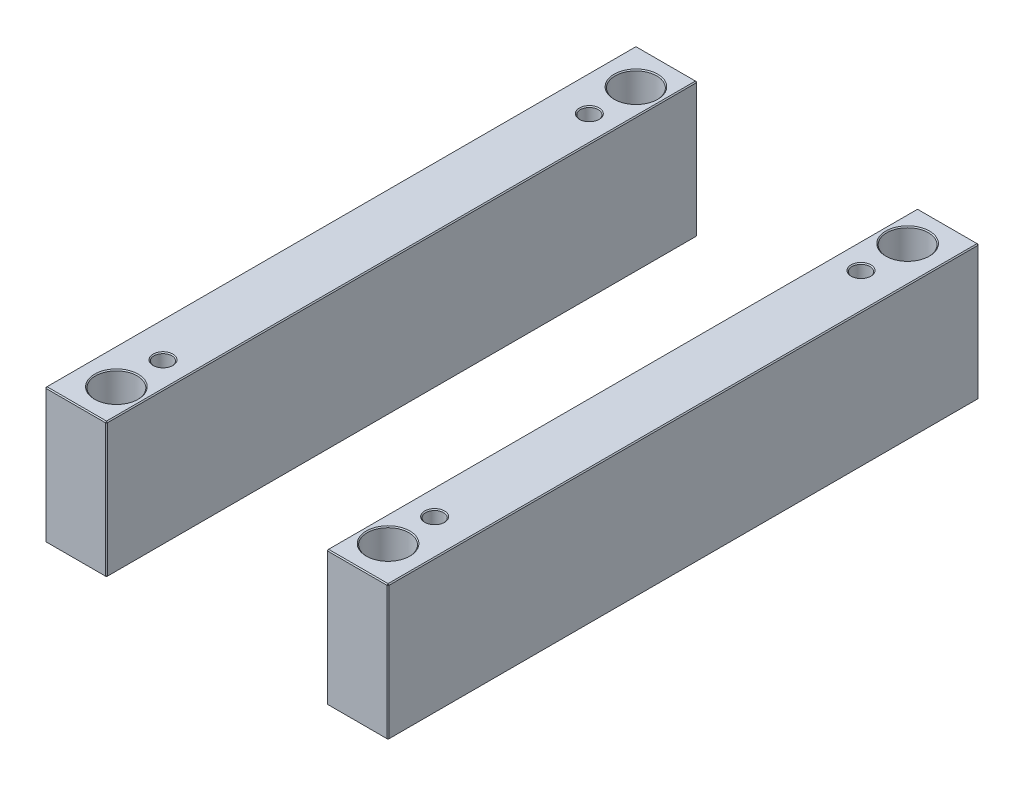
ISO-10303-21;
HEADER;
FILE_DESCRIPTION(('STEP AP214'),'2;1');
FILE_NAME('part.step','',(''),(''),'','','');
FILE_SCHEMA(('AUTOMOTIVE_DESIGN { 1 0 10303 214 1 1 1 1 }'));
ENDSEC;
DATA;
#1=APPLICATION_CONTEXT('core data for automotive mechanical design processes');
#2=APPLICATION_PROTOCOL_DEFINITION('international standard','automotive_design',2000,#1);
#3=PRODUCT_CONTEXT('',#1,'mechanical');
#4=PRODUCT('Part','Part','',(#3));
#5=PRODUCT_RELATED_PRODUCT_CATEGORY('part','',(#4));
#6=PRODUCT_DEFINITION_FORMATION('','',#4);
#7=PRODUCT_DEFINITION_CONTEXT('part definition',#1,'design');
#8=PRODUCT_DEFINITION('design','',#6,#7);
#9=PRODUCT_DEFINITION_SHAPE('','',#8);
#10=(LENGTH_UNIT() NAMED_UNIT(*) SI_UNIT(.MILLI.,.METRE.));
#11=(NAMED_UNIT(*) PLANE_ANGLE_UNIT() SI_UNIT($,.RADIAN.));
#12=(NAMED_UNIT(*) SI_UNIT($,.STERADIAN.) SOLID_ANGLE_UNIT());
#13=UNCERTAINTY_MEASURE_WITH_UNIT(LENGTH_MEASURE(1.E-05),#10,'distance_accuracy_value','');
#14=(GEOMETRIC_REPRESENTATION_CONTEXT(3) GLOBAL_UNCERTAINTY_ASSIGNED_CONTEXT((#13)) GLOBAL_UNIT_ASSIGNED_CONTEXT((#10,
#11,#12)) REPRESENTATION_CONTEXT('',''));
#15=CARTESIAN_POINT('',(0.,0.,0.));
#16=DIRECTION('',(0.,0.,1.));
#17=DIRECTION('',(1.,0.,0.));
#18=AXIS2_PLACEMENT_3D('',#15,#16,#17);
#19=CARTESIAN_POINT('',(-173.,136.,-298.));
#20=DIRECTION('',(0.,0.,1.));
#21=DIRECTION('',(1.,0.,0.));
#22=AXIS2_PLACEMENT_3D('',#19,#20,#21);
#23=PLANE('',#22);
#24=DIRECTION('',(-1.,0.,0.));
#25=VECTOR('',#24,1.);
#26=CARTESIAN_POINT('',(-173.,0.999999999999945,-298.));
#27=LINE('',#26,#25);
#28=CARTESIAN_POINT('',(-112.,0.999999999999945,-298.));
#29=VERTEX_POINT('',#28);
#30=CARTESIAN_POINT('',(-172.,0.999999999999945,-298.));
#31=VERTEX_POINT('',#30);
#32=EDGE_CURVE('P0_E137',#29,#31,#27,.T.);
#33=ORIENTED_EDGE('',*,*,#32,.T.);
#34=DIRECTION('',(0.,1.,0.));
#35=VECTOR('',#34,1.);
#36=CARTESIAN_POINT('',(-172.,136.,-298.));
#37=LINE('',#36,#35);
#38=CARTESIAN_POINT('',(-172.,135.,-298.));
#39=VERTEX_POINT('',#38);
#40=EDGE_CURVE('P0_E265',#31,#39,#37,.T.);
#41=ORIENTED_EDGE('',*,*,#40,.T.);
#42=DIRECTION('',(1.,0.,0.));
#43=VECTOR('',#42,1.);
#44=CARTESIAN_POINT('',(-173.,135.,-298.));
#45=LINE('',#44,#43);
#46=CARTESIAN_POINT('',(-112.,135.,-298.));
#47=VERTEX_POINT('',#46);
#48=EDGE_CURVE('P0_E263',#39,#47,#45,.T.);
#49=ORIENTED_EDGE('',*,*,#48,.T.);
#50=DIRECTION('',(0.,-1.,0.));
#51=VECTOR('',#50,1.);
#52=CARTESIAN_POINT('',(-112.,136.,-298.));
#53=LINE('',#52,#51);
#54=EDGE_CURVE('P0_E260',#47,#29,#53,.T.);
#55=ORIENTED_EDGE('',*,*,#54,.T.);
#56=EDGE_LOOP('',(#33,#41,#49,#55));
#57=FACE_BOUND('',#56,.T.);
#58=ADVANCED_FACE('P0_F16',(#57),#23,.F.);
#59=CARTESIAN_POINT('',(-173.,136.,298.));
#60=DIRECTION('',(1.,0.,0.));
#61=DIRECTION('',(0.,0.,-1.));
#62=AXIS2_PLACEMENT_3D('',#59,#60,#61);
#63=PLANE('',#62);
#64=DIRECTION('',(0.,1.,0.));
#65=VECTOR('',#64,1.);
#66=CARTESIAN_POINT('',(-173.,136.,297.));
#67=LINE('',#66,#65);
#68=CARTESIAN_POINT('',(-173.,0.999999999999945,297.));
#69=VERTEX_POINT('',#68);
#70=CARTESIAN_POINT('',(-173.,135.,297.));
#71=VERTEX_POINT('',#70);
#72=EDGE_CURVE('P0_E253',#69,#71,#67,.T.);
#73=ORIENTED_EDGE('',*,*,#72,.T.);
#74=DIRECTION('',(0.,0.,-1.));
#75=VECTOR('',#74,1.);
#76=CARTESIAN_POINT('',(-173.,135.,298.));
#77=LINE('',#76,#75);
#78=CARTESIAN_POINT('',(-173.,135.,-297.));
#79=VERTEX_POINT('',#78);
#80=EDGE_CURVE('P0_E258',#71,#79,#77,.T.);
#81=ORIENTED_EDGE('',*,*,#80,.T.);
#82=DIRECTION('',(0.,-1.,0.));
#83=VECTOR('',#82,1.);
#84=CARTESIAN_POINT('',(-173.,136.,-297.));
#85=LINE('',#84,#83);
#86=CARTESIAN_POINT('',(-173.,0.999999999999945,-297.));
#87=VERTEX_POINT('',#86);
#88=EDGE_CURVE('P0_E255',#79,#87,#85,.T.);
#89=ORIENTED_EDGE('',*,*,#88,.T.);
#90=DIRECTION('',(0.,0.,1.));
#91=VECTOR('',#90,1.);
#92=CARTESIAN_POINT('',(-173.,0.999999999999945,298.));
#93=LINE('',#92,#91);
#94=EDGE_CURVE('P0_E251',#87,#69,#93,.T.);
#95=ORIENTED_EDGE('',*,*,#94,.T.);
#96=EDGE_LOOP('',(#73,#81,#89,#95));
#97=FACE_BOUND('',#96,.T.);
#98=ADVANCED_FACE('P0_F333',(#97),#63,.F.);
#99=CARTESIAN_POINT('',(-173.,136.,298.));
#100=DIRECTION('',(0.,0.,-1.));
#101=DIRECTION('',(-1.,0.,0.));
#102=AXIS2_PLACEMENT_3D('',#99,#100,#101);
#103=PLANE('',#102);
#104=DIRECTION('',(-1.,0.,0.));
#105=VECTOR('',#104,1.);
#106=CARTESIAN_POINT('',(-173.,135.,298.));
#107=LINE('',#106,#105);
#108=CARTESIAN_POINT('',(-112.,135.,298.));
#109=VERTEX_POINT('',#108);
#110=CARTESIAN_POINT('',(-172.,135.,298.));
#111=VERTEX_POINT('',#110);
#112=EDGE_CURVE('P0_E272',#109,#111,#107,.T.);
#113=ORIENTED_EDGE('',*,*,#112,.T.);
#114=DIRECTION('',(0.,-1.,0.));
#115=VECTOR('',#114,1.);
#116=CARTESIAN_POINT('',(-172.,136.,298.));
#117=LINE('',#116,#115);
#118=CARTESIAN_POINT('',(-172.,0.999999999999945,298.));
#119=VERTEX_POINT('',#118);
#120=EDGE_CURVE('P0_E274',#111,#119,#117,.T.);
#121=ORIENTED_EDGE('',*,*,#120,.T.);
#122=DIRECTION('',(1.,0.,0.));
#123=VECTOR('',#122,1.);
#124=CARTESIAN_POINT('',(-111.,0.999999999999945,298.));
#125=LINE('',#124,#123);
#126=CARTESIAN_POINT('',(-112.,0.999999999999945,298.));
#127=VERTEX_POINT('',#126);
#128=EDGE_CURVE('P0_E270',#119,#127,#125,.T.);
#129=ORIENTED_EDGE('',*,*,#128,.T.);
#130=DIRECTION('',(0.,1.,0.));
#131=VECTOR('',#130,1.);
#132=CARTESIAN_POINT('',(-112.,136.,298.));
#133=LINE('',#132,#131);
#134=EDGE_CURVE('P0_E268',#127,#109,#133,.T.);
#135=ORIENTED_EDGE('',*,*,#134,.T.);
#136=EDGE_LOOP('',(#113,#121,#129,#135));
#137=FACE_BOUND('',#136,.T.);
#138=ADVANCED_FACE('P0_F372',(#137),#103,.F.);
#139=CARTESIAN_POINT('',(-111.,136.,-298.));
#140=DIRECTION('',(-1.,0.,0.));
#141=DIRECTION('',(0.,0.,1.));
#142=AXIS2_PLACEMENT_3D('',#139,#140,#141);
#143=PLANE('',#142);
#144=DIRECTION('',(0.,0.,1.));
#145=VECTOR('',#144,1.);
#146=CARTESIAN_POINT('',(-111.,135.,-298.));
#147=LINE('',#146,#145);
#148=CARTESIAN_POINT('',(-111.,135.,-297.));
#149=VERTEX_POINT('',#148);
#150=CARTESIAN_POINT('',(-111.,135.,297.));
#151=VERTEX_POINT('',#150);
#152=EDGE_CURVE('P0_E31',#149,#151,#147,.T.);
#153=ORIENTED_EDGE('',*,*,#152,.T.);
#154=DIRECTION('',(0.,-1.,0.));
#155=VECTOR('',#154,1.);
#156=CARTESIAN_POINT('',(-111.,136.,297.));
#157=LINE('',#156,#155);
#158=CARTESIAN_POINT('',(-111.,0.999999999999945,297.));
#159=VERTEX_POINT('',#158);
#160=EDGE_CURVE('P0_E190',#151,#159,#157,.T.);
#161=ORIENTED_EDGE('',*,*,#160,.T.);
#162=DIRECTION('',(0.,0.,-1.));
#163=VECTOR('',#162,1.);
#164=CARTESIAN_POINT('',(-111.,0.999999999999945,-298.));
#165=LINE('',#164,#163);
#166=CARTESIAN_POINT('',(-111.,0.999999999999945,-297.));
#167=VERTEX_POINT('',#166);
#168=EDGE_CURVE('P0_E286',#159,#167,#165,.T.);
#169=ORIENTED_EDGE('',*,*,#168,.T.);
#170=DIRECTION('',(0.,1.,0.));
#171=VECTOR('',#170,1.);
#172=CARTESIAN_POINT('',(-111.,136.,-297.));
#173=LINE('',#172,#171);
#174=EDGE_CURVE('P0_E36',#167,#149,#173,.T.);
#175=ORIENTED_EDGE('',*,*,#174,.T.);
#176=EDGE_LOOP('',(#153,#161,#169,#175));
#177=FACE_BOUND('',#176,.T.);
#178=ADVANCED_FACE('P0_F649',(#177),#143,.F.);
#179=CARTESIAN_POINT('',(0.,136.,0.));
#180=DIRECTION('',(0.,-1.,0.));
#181=DIRECTION('',(0.,0.,-1.));
#182=AXIS2_PLACEMENT_3D('',#179,#180,#181);
#183=PLANE('',#182);
#184=CARTESIAN_POINT('',(-137.,136.,-262.));
#185=DIRECTION('',(0.,-1.,0.));
#186=DIRECTION('',(0.,0.,-1.));
#187=AXIS2_PLACEMENT_3D('',#184,#185,#186);
#188=CIRCLE('',#187,22.);
#189=CARTESIAN_POINT('',(-137.,136.,-284.));
#190=VERTEX_POINT('',#189);
#191=EDGE_CURVE('P0_E214',#190,#190,#188,.T.);
#192=ORIENTED_EDGE('',*,*,#191,.T.);
#193=EDGE_LOOP('',(#192));
#194=FACE_BOUND('',#193,.T.);
#195=CARTESIAN_POINT('',(-137.,136.,262.));
#196=DIRECTION('',(0.,-1.,0.));
#197=DIRECTION('',(0.,0.,-1.));
#198=AXIS2_PLACEMENT_3D('',#195,#196,#197);
#199=CIRCLE('',#198,22.);
#200=CARTESIAN_POINT('',(-137.,136.,240.));
#201=VERTEX_POINT('',#200);
#202=EDGE_CURVE('P0_E211',#201,#201,#199,.T.);
#203=ORIENTED_EDGE('',*,*,#202,.T.);
#204=EDGE_LOOP('',(#203));
#205=FACE_BOUND('',#204,.T.);
#206=CARTESIAN_POINT('',(-137.,136.,215.));
#207=DIRECTION('',(0.,-1.,0.));
#208=DIRECTION('',(0.,0.,-1.));
#209=AXIS2_PLACEMENT_3D('',#206,#207,#208);
#210=CIRCLE('',#209,10.);
#211=CARTESIAN_POINT('',(-137.,136.,205.));
#212=VERTEX_POINT('',#211);
#213=EDGE_CURVE('P0_E193',#212,#212,#210,.T.);
#214=ORIENTED_EDGE('',*,*,#213,.T.);
#215=EDGE_LOOP('',(#214));
#216=FACE_BOUND('',#215,.T.);
#217=CARTESIAN_POINT('',(-137.,136.,-215.));
#218=DIRECTION('',(0.,-1.,0.));
#219=DIRECTION('',(0.,0.,-1.));
#220=AXIS2_PLACEMENT_3D('',#217,#218,#219);
#221=CIRCLE('',#220,10.);
#222=CARTESIAN_POINT('',(-137.,136.,-225.));
#223=VERTEX_POINT('',#222);
#224=EDGE_CURVE('P0_E189',#223,#223,#221,.T.);
#225=ORIENTED_EDGE('',*,*,#224,.T.);
#226=EDGE_LOOP('',(#225));
#227=FACE_BOUND('',#226,.T.);
#228=DIRECTION('',(0.,0.,1.));
#229=VECTOR('',#228,1.);
#230=CARTESIAN_POINT('',(-172.,136.,0.));
#231=LINE('',#230,#229);
#232=CARTESIAN_POINT('',(-172.,136.,-297.));
#233=VERTEX_POINT('',#232);
#234=CARTESIAN_POINT('',(-172.,136.,297.));
#235=VERTEX_POINT('',#234);
#236=EDGE_CURVE('P0_E281',#233,#235,#231,.T.);
#237=ORIENTED_EDGE('',*,*,#236,.T.);
#238=DIRECTION('',(1.,0.,0.));
#239=VECTOR('',#238,1.);
#240=CARTESIAN_POINT('',(2.65916321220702E-13,136.,297.));
#241=LINE('',#240,#239);
#242=CARTESIAN_POINT('',(-112.,136.,297.));
#243=VERTEX_POINT('',#242);
#244=EDGE_CURVE('P0_E283',#235,#243,#241,.T.);
#245=ORIENTED_EDGE('',*,*,#244,.T.);
#246=DIRECTION('',(0.,0.,-1.));
#247=VECTOR('',#246,1.);
#248=CARTESIAN_POINT('',(-112.,136.,0.));
#249=LINE('',#248,#247);
#250=CARTESIAN_POINT('',(-112.,136.,-297.));
#251=VERTEX_POINT('',#250);
#252=EDGE_CURVE('P0_E277',#243,#251,#249,.T.);
#253=ORIENTED_EDGE('',*,*,#252,.T.);
#254=DIRECTION('',(-1.,0.,0.));
#255=VECTOR('',#254,1.);
#256=CARTESIAN_POINT('',(-2.65916321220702E-13,136.,-297.));
#257=LINE('',#256,#255);
#258=EDGE_CURVE('P0_E279',#251,#233,#257,.T.);
#259=ORIENTED_EDGE('',*,*,#258,.T.);
#260=EDGE_LOOP('',(#237,#245,#253,#259));
#261=FACE_BOUND('',#260,.T.);
#262=ADVANCED_FACE('P0_F229',(#194,#205,#216,#227,#261),#183,.F.);
#263=CARTESIAN_POINT('',(0.,0.,0.));
#264=DIRECTION('',(0.,-1.,0.));
#265=DIRECTION('',(0.,0.,-1.));
#266=AXIS2_PLACEMENT_3D('',#263,#264,#265);
#267=PLANE('',#266);
#268=CARTESIAN_POINT('',(-137.,0.,-262.));
#269=DIRECTION('',(0.,-1.,0.));
#270=DIRECTION('',(0.,0.,-1.));
#271=AXIS2_PLACEMENT_3D('',#268,#269,#270);
#272=CIRCLE('',#271,22.);
#273=CARTESIAN_POINT('',(-137.,0.,-284.));
#274=VERTEX_POINT('',#273);
#275=EDGE_CURVE('P0_E202',#274,#274,#272,.F.);
#276=ORIENTED_EDGE('',*,*,#275,.T.);
#277=EDGE_LOOP('',(#276));
#278=FACE_BOUND('',#277,.T.);
#279=CARTESIAN_POINT('',(-137.,0.,262.));
#280=DIRECTION('',(0.,-1.,0.));
#281=DIRECTION('',(0.,0.,-1.));
#282=AXIS2_PLACEMENT_3D('',#279,#280,#281);
#283=CIRCLE('',#282,22.);
#284=CARTESIAN_POINT('',(-137.,0.,240.));
#285=VERTEX_POINT('',#284);
#286=EDGE_CURVE('P0_E199',#285,#285,#283,.F.);
#287=ORIENTED_EDGE('',*,*,#286,.T.);
#288=EDGE_LOOP('',(#287));
#289=FACE_BOUND('',#288,.T.);
#290=CARTESIAN_POINT('',(-137.,0.,-215.));
#291=DIRECTION('',(0.,-1.,0.));
#292=DIRECTION('',(0.,0.,-1.));
#293=AXIS2_PLACEMENT_3D('',#290,#291,#292);
#294=CIRCLE('',#293,10.);
#295=CARTESIAN_POINT('',(-137.,0.,-225.));
#296=VERTEX_POINT('',#295);
#297=EDGE_CURVE('P0_E235',#296,#296,#294,.F.);
#298=ORIENTED_EDGE('',*,*,#297,.T.);
#299=EDGE_LOOP('',(#298));
#300=FACE_BOUND('',#299,.T.);
#301=CARTESIAN_POINT('',(-137.,0.,215.));
#302=DIRECTION('',(0.,-1.,0.));
#303=DIRECTION('',(0.,0.,-1.));
#304=AXIS2_PLACEMENT_3D('',#301,#302,#303);
#305=CIRCLE('',#304,10.);
#306=CARTESIAN_POINT('',(-137.,0.,205.));
#307=VERTEX_POINT('',#306);
#308=EDGE_CURVE('P0_E238',#307,#307,#305,.F.);
#309=ORIENTED_EDGE('',*,*,#308,.T.);
#310=EDGE_LOOP('',(#309));
#311=FACE_BOUND('',#310,.T.);
#312=DIRECTION('',(-1.,0.,0.));
#313=VECTOR('',#312,1.);
#314=CARTESIAN_POINT('',(-173.,0.,297.));
#315=LINE('',#314,#313);
#316=CARTESIAN_POINT('',(-112.,0.,297.));
#317=VERTEX_POINT('',#316);
#318=CARTESIAN_POINT('',(-172.,0.,297.));
#319=VERTEX_POINT('',#318);
#320=EDGE_CURVE('P0_E114',#317,#319,#315,.T.);
#321=ORIENTED_EDGE('',*,*,#320,.T.);
#322=DIRECTION('',(0.,0.,-1.));
#323=VECTOR('',#322,1.);
#324=CARTESIAN_POINT('',(-172.,0.,-298.));
#325=LINE('',#324,#323);
#326=CARTESIAN_POINT('',(-172.,0.,-297.));
#327=VERTEX_POINT('',#326);
#328=EDGE_CURVE('P0_E110',#319,#327,#325,.T.);
#329=ORIENTED_EDGE('',*,*,#328,.T.);
#330=DIRECTION('',(1.,0.,0.));
#331=VECTOR('',#330,1.);
#332=CARTESIAN_POINT('',(-111.,0.,-297.));
#333=LINE('',#332,#331);
#334=CARTESIAN_POINT('',(-112.,0.,-297.));
#335=VERTEX_POINT('',#334);
#336=EDGE_CURVE('P0_E104',#327,#335,#333,.T.);
#337=ORIENTED_EDGE('',*,*,#336,.T.);
#338=DIRECTION('',(0.,0.,1.));
#339=VECTOR('',#338,1.);
#340=CARTESIAN_POINT('',(-112.,0.,298.));
#341=LINE('',#340,#339);
#342=EDGE_CURVE('P0_E107',#335,#317,#341,.T.);
#343=ORIENTED_EDGE('',*,*,#342,.T.);
#344=EDGE_LOOP('',(#321,#329,#337,#343));
#345=FACE_BOUND('',#344,.T.);
#346=ADVANCED_FACE('P0_F106',(#278,#289,#300,#311,#345),#267,.T.);
#347=CARTESIAN_POINT('',(-137.,0.,-215.));
#348=DIRECTION('',(0.,1.,0.));
#349=DIRECTION('',(0.,0.,1.));
#350=AXIS2_PLACEMENT_3D('',#347,#348,#349);
#351=CYLINDRICAL_SURFACE('',#350,9.);
#352=CARTESIAN_POINT('',(-137.,135.,-215.));
#353=DIRECTION('',(0.,-1.,0.));
#354=DIRECTION('',(0.,0.,-1.));
#355=AXIS2_PLACEMENT_3D('',#352,#353,#354);
#356=CIRCLE('',#355,9.);
#357=CARTESIAN_POINT('',(-137.,135.,-224.));
#358=VERTEX_POINT('',#357);
#359=EDGE_CURVE('P0_E196',#358,#358,#356,.F.);
#360=ORIENTED_EDGE('',*,*,#359,.T.);
#361=EDGE_LOOP('',(#360));
#362=FACE_BOUND('',#361,.T.);
#363=CARTESIAN_POINT('',(-137.,0.999999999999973,-215.));
#364=DIRECTION('',(0.,-1.,0.));
#365=DIRECTION('',(0.,0.,-1.));
#366=AXIS2_PLACEMENT_3D('',#363,#364,#365);
#367=CIRCLE('',#366,9.);
#368=CARTESIAN_POINT('',(-137.,0.999999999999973,-224.));
#369=VERTEX_POINT('',#368);
#370=EDGE_CURVE('P0_E241',#369,#369,#367,.T.);
#371=ORIENTED_EDGE('',*,*,#370,.T.);
#372=EDGE_LOOP('',(#371));
#373=FACE_BOUND('',#372,.T.);
#374=ADVANCED_FACE('P0_F228',(#362,#373),#351,.F.);
#375=CARTESIAN_POINT('',(-137.,0.,215.));
#376=DIRECTION('',(0.,1.,0.));
#377=DIRECTION('',(0.,0.,1.));
#378=AXIS2_PLACEMENT_3D('',#375,#376,#377);
#379=CYLINDRICAL_SURFACE('',#378,9.);
#380=CARTESIAN_POINT('',(-137.,135.,215.));
#381=DIRECTION('',(0.,-1.,0.));
#382=DIRECTION('',(0.,0.,-1.));
#383=AXIS2_PLACEMENT_3D('',#380,#381,#382);
#384=CIRCLE('',#383,9.);
#385=CARTESIAN_POINT('',(-137.,135.,206.));
#386=VERTEX_POINT('',#385);
#387=EDGE_CURVE('P0_E186',#386,#386,#384,.F.);
#388=ORIENTED_EDGE('',*,*,#387,.T.);
#389=EDGE_LOOP('',(#388));
#390=FACE_BOUND('',#389,.T.);
#391=CARTESIAN_POINT('',(-137.,0.999999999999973,215.));
#392=DIRECTION('',(0.,-1.,0.));
#393=DIRECTION('',(0.,0.,-1.));
#394=AXIS2_PLACEMENT_3D('',#391,#392,#393);
#395=CIRCLE('',#394,9.);
#396=CARTESIAN_POINT('',(-137.,0.999999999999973,206.));
#397=VERTEX_POINT('',#396);
#398=EDGE_CURVE('P0_E248',#397,#397,#395,.T.);
#399=ORIENTED_EDGE('',*,*,#398,.T.);
#400=EDGE_LOOP('',(#399));
#401=FACE_BOUND('',#400,.T.);
#402=ADVANCED_FACE('P0_F380',(#390,#401),#379,.F.);
#403=CARTESIAN_POINT('',(-137.,0.,-215.));
#404=DIRECTION('',(0.,-1.,0.));
#405=DIRECTION('',(0.,0.,-1.));
#406=AXIS2_PLACEMENT_3D('',#403,#404,#405);
#407=CONICAL_SURFACE('',#406,10.,0.785398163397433);
#408=ORIENTED_EDGE('',*,*,#370,.F.);
#409=EDGE_LOOP('',(#408));
#410=FACE_BOUND('',#409,.T.);
#411=ORIENTED_EDGE('',*,*,#297,.F.);
#412=EDGE_LOOP('',(#411));
#413=FACE_BOUND('',#412,.T.);
#414=ADVANCED_FACE('P0_F376',(#410,#413),#407,.F.);
#415=CARTESIAN_POINT('',(-137.,0.,215.));
#416=DIRECTION('',(0.,-1.,0.));
#417=DIRECTION('',(0.,0.,-1.));
#418=AXIS2_PLACEMENT_3D('',#415,#416,#417);
#419=CONICAL_SURFACE('',#418,10.,0.785398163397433);
#420=ORIENTED_EDGE('',*,*,#398,.F.);
#421=EDGE_LOOP('',(#420));
#422=FACE_BOUND('',#421,.T.);
#423=ORIENTED_EDGE('',*,*,#308,.F.);
#424=EDGE_LOOP('',(#423));
#425=FACE_BOUND('',#424,.T.);
#426=ADVANCED_FACE('P0_F379',(#422,#425),#419,.F.);
#427=CARTESIAN_POINT('',(-111.,136.,297.));
#428=DIRECTION('',(-0.707106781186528,0.,-0.707106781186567));
#429=DIRECTION('',(0.,-1.,0.));
#430=AXIS2_PLACEMENT_3D('',#427,#428,#429);
#431=PLANE('',#430);
#432=DIRECTION('',(-0.707106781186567,0.,0.707106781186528));
#433=VECTOR('',#432,1.);
#434=CARTESIAN_POINT('',(-111.5,135.,297.5));
#435=LINE('',#434,#433);
#436=EDGE_CURVE('P0_E125',#109,#151,#435,.F.);
#437=ORIENTED_EDGE('',*,*,#436,.F.);
#438=ORIENTED_EDGE('',*,*,#134,.F.);
#439=DIRECTION('',(0.707106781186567,0.,-0.707106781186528));
#440=VECTOR('',#439,1.);
#441=CARTESIAN_POINT('',(-112.,0.999999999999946,298.));
#442=LINE('',#441,#440);
#443=EDGE_CURVE('P0_E181',#159,#127,#442,.F.);
#444=ORIENTED_EDGE('',*,*,#443,.F.);
#445=ORIENTED_EDGE('',*,*,#160,.F.);
#446=EDGE_LOOP('',(#437,#438,#444,#445));
#447=FACE_BOUND('',#446,.T.);
#448=ADVANCED_FACE('P0_F384',(#447),#431,.F.);
#449=CARTESIAN_POINT('',(-112.,136.,297.));
#450=DIRECTION('',(0.577350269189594,0.577350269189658,0.577350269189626));
#451=DIRECTION('',(0.,-0.707106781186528,0.707106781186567));
#452=AXIS2_PLACEMENT_3D('',#449,#450,#451);
#453=PLANE('',#452);
#454=DIRECTION('',(0.,0.707106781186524,-0.707106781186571));
#455=VECTOR('',#454,1.);
#456=CARTESIAN_POINT('',(-112.,136.,297.));
#457=LINE('',#456,#455);
#458=EDGE_CURVE('P0_E175',#109,#243,#457,.T.);
#459=ORIENTED_EDGE('',*,*,#458,.F.);
#460=ORIENTED_EDGE('',*,*,#436,.T.);
#461=DIRECTION('',(0.707106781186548,-0.707106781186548,0.));
#462=VECTOR('',#461,1.);
#463=CARTESIAN_POINT('',(-112.,136.,297.));
#464=LINE('',#463,#462);
#465=EDGE_CURVE('P0_E178',#243,#151,#464,.T.);
#466=ORIENTED_EDGE('',*,*,#465,.F.);
#467=EDGE_LOOP('',(#459,#460,#466));
#468=FACE_BOUND('',#467,.T.);
#469=ADVANCED_FACE('P0_F588',(#468),#453,.T.);
#470=CARTESIAN_POINT('',(-112.,0.999999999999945,298.));
#471=DIRECTION('',(0.577350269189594,-0.577350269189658,0.577350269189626));
#472=DIRECTION('',(0.,-0.707106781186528,-0.707106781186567));
#473=AXIS2_PLACEMENT_3D('',#470,#471,#472);
#474=PLANE('',#473);
#475=DIRECTION('',(0.707106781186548,0.707106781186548,0.));
#476=VECTOR('',#475,1.);
#477=CARTESIAN_POINT('',(-111.5,0.500000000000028,297.));
#478=LINE('',#477,#476);
#479=EDGE_CURVE('P0_E123',#159,#317,#478,.F.);
#480=ORIENTED_EDGE('',*,*,#479,.F.);
#481=ORIENTED_EDGE('',*,*,#443,.T.);
#482=DIRECTION('',(0.,-0.707106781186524,-0.707106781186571));
#483=VECTOR('',#482,1.);
#484=CARTESIAN_POINT('',(-112.,0.999999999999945,298.));
#485=LINE('',#484,#483);
#486=EDGE_CURVE('P0_E172',#317,#127,#485,.F.);
#487=ORIENTED_EDGE('',*,*,#486,.F.);
#488=EDGE_LOOP('',(#480,#481,#487));
#489=FACE_BOUND('',#488,.T.);
#490=ADVANCED_FACE('P0_F597',(#489),#474,.T.);
#491=CARTESIAN_POINT('',(-112.,136.,0.));
#492=DIRECTION('',(-0.707106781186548,-0.707106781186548,0.));
#493=DIRECTION('',(0.,0.,-1.));
#494=AXIS2_PLACEMENT_3D('',#491,#492,#493);
#495=PLANE('',#494);
#496=ORIENTED_EDGE('',*,*,#465,.T.);
#497=ORIENTED_EDGE('',*,*,#152,.F.);
#498=DIRECTION('',(-0.707106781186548,0.707106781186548,0.));
#499=VECTOR('',#498,1.);
#500=CARTESIAN_POINT('',(-111.5,135.5,-297.));
#501=LINE('',#500,#499);
#502=EDGE_CURVE('P0_E165',#251,#149,#501,.F.);
#503=ORIENTED_EDGE('',*,*,#502,.F.);
#504=ORIENTED_EDGE('',*,*,#252,.F.);
#505=EDGE_LOOP('',(#496,#497,#503,#504));
#506=FACE_BOUND('',#505,.T.);
#507=ADVANCED_FACE('P0_F349',(#506),#495,.F.);
#508=CARTESIAN_POINT('',(2.65916321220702E-13,136.,297.));
#509=DIRECTION('',(0.,-0.707106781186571,-0.707106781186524));
#510=DIRECTION('',(1.,0.,0.));
#511=AXIS2_PLACEMENT_3D('',#508,#509,#510);
#512=PLANE('',#511);
#513=ORIENTED_EDGE('',*,*,#458,.T.);
#514=ORIENTED_EDGE('',*,*,#244,.F.);
#515=DIRECTION('',(0.,-0.707106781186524,0.707106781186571));
#516=VECTOR('',#515,1.);
#517=CARTESIAN_POINT('',(-172.,135.5,297.5));
#518=LINE('',#517,#516);
#519=EDGE_CURVE('P0_E162',#111,#235,#518,.F.);
#520=ORIENTED_EDGE('',*,*,#519,.F.);
#521=ORIENTED_EDGE('',*,*,#112,.F.);
#522=EDGE_LOOP('',(#513,#514,#520,#521));
#523=FACE_BOUND('',#522,.T.);
#524=ADVANCED_FACE('P0_F344',(#523),#512,.F.);
#525=CARTESIAN_POINT('',(-172.,136.,298.));
#526=DIRECTION('',(0.707106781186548,0.,-0.707106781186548));
#527=DIRECTION('',(0.,-1.,0.));
#528=AXIS2_PLACEMENT_3D('',#525,#526,#527);
#529=PLANE('',#528);
#530=DIRECTION('',(0.707106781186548,0.,0.707106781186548));
#531=VECTOR('',#530,1.);
#532=CARTESIAN_POINT('',(-172.,0.999999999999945,298.));
#533=LINE('',#532,#531);
#534=EDGE_CURVE('P0_E156',#119,#69,#533,.F.);
#535=ORIENTED_EDGE('',*,*,#534,.F.);
#536=ORIENTED_EDGE('',*,*,#120,.F.);
#537=DIRECTION('',(-0.707106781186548,0.,-0.707106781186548));
#538=VECTOR('',#537,1.);
#539=CARTESIAN_POINT('',(-173.,135.,297.));
#540=LINE('',#539,#538);
#541=EDGE_CURVE('P0_E159',#71,#111,#540,.F.);
#542=ORIENTED_EDGE('',*,*,#541,.F.);
#543=ORIENTED_EDGE('',*,*,#72,.F.);
#544=EDGE_LOOP('',(#535,#536,#542,#543));
#545=FACE_BOUND('',#544,.T.);
#546=ADVANCED_FACE('P0_F338',(#545),#529,.F.);
#547=CARTESIAN_POINT('',(-173.,0.999999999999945,298.));
#548=DIRECTION('',(0.,-0.707106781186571,0.707106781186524));
#549=DIRECTION('',(-1.,0.,0.));
#550=AXIS2_PLACEMENT_3D('',#547,#548,#549);
#551=PLANE('',#550);
#552=ORIENTED_EDGE('',*,*,#486,.T.);
#553=ORIENTED_EDGE('',*,*,#128,.F.);
#554=DIRECTION('',(0.,0.707106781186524,0.707106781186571));
#555=VECTOR('',#554,1.);
#556=CARTESIAN_POINT('',(-172.,0.999999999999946,298.));
#557=LINE('',#556,#555);
#558=EDGE_CURVE('P0_E134',#319,#119,#557,.T.);
#559=ORIENTED_EDGE('',*,*,#558,.F.);
#560=ORIENTED_EDGE('',*,*,#320,.F.);
#561=EDGE_LOOP('',(#552,#553,#559,#560));
#562=FACE_BOUND('',#561,.T.);
#563=ADVANCED_FACE('P0_F364',(#562),#551,.T.);
#564=CARTESIAN_POINT('',(-111.,0.999999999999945,-298.));
#565=DIRECTION('',(0.707106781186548,-0.707106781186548,0.));
#566=DIRECTION('',(0.,0.,1.));
#567=AXIS2_PLACEMENT_3D('',#564,#565,#566);
#568=PLANE('',#567);
#569=ORIENTED_EDGE('',*,*,#479,.T.);
#570=ORIENTED_EDGE('',*,*,#342,.F.);
#571=DIRECTION('',(-0.707106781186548,-0.707106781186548,0.));
#572=VECTOR('',#571,1.);
#573=CARTESIAN_POINT('',(-112.,0.,-297.));
#574=LINE('',#573,#572);
#575=EDGE_CURVE('P0_E120',#167,#335,#574,.T.);
#576=ORIENTED_EDGE('',*,*,#575,.F.);
#577=ORIENTED_EDGE('',*,*,#168,.F.);
#578=EDGE_LOOP('',(#569,#570,#576,#577));
#579=FACE_BOUND('',#578,.T.);
#580=ADVANCED_FACE('P0_F119',(#579),#568,.T.);
#581=CARTESIAN_POINT('',(-112.,136.,-298.));
#582=DIRECTION('',(-0.707106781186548,0.,0.707106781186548));
#583=DIRECTION('',(0.,-1.,0.));
#584=AXIS2_PLACEMENT_3D('',#581,#582,#583);
#585=PLANE('',#584);
#586=DIRECTION('',(0.707106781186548,0.,0.707106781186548));
#587=VECTOR('',#586,1.);
#588=CARTESIAN_POINT('',(-112.,135.,-298.));
#589=LINE('',#588,#587);
#590=EDGE_CURVE('P0_E168',#149,#47,#589,.F.);
#591=ORIENTED_EDGE('',*,*,#590,.F.);
#592=ORIENTED_EDGE('',*,*,#174,.F.);
#593=DIRECTION('',(-0.707106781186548,0.,-0.707106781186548));
#594=VECTOR('',#593,1.);
#595=CARTESIAN_POINT('',(-111.5,0.999999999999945,-297.5));
#596=LINE('',#595,#594);
#597=EDGE_CURVE('P0_E133',#29,#167,#596,.F.);
#598=ORIENTED_EDGE('',*,*,#597,.F.);
#599=ORIENTED_EDGE('',*,*,#54,.F.);
#600=EDGE_LOOP('',(#591,#592,#598,#599));
#601=FACE_BOUND('',#600,.T.);
#602=ADVANCED_FACE('P0_F354',(#601),#585,.F.);
#603=CARTESIAN_POINT('',(-112.,135.,-298.));
#604=DIRECTION('',(0.577350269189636,0.577350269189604,-0.577350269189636));
#605=DIRECTION('',(-0.707106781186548,0.,-0.707106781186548));
#606=AXIS2_PLACEMENT_3D('',#603,#604,#605);
#607=PLANE('',#606);
#608=ORIENTED_EDGE('',*,*,#502,.T.);
#609=ORIENTED_EDGE('',*,*,#590,.T.);
#610=DIRECTION('',(0.,-0.707106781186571,-0.707106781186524));
#611=VECTOR('',#610,1.);
#612=CARTESIAN_POINT('',(-112.,135.,-298.));
#613=LINE('',#612,#611);
#614=EDGE_CURVE('P0_E151',#251,#47,#613,.T.);
#615=ORIENTED_EDGE('',*,*,#614,.F.);
#616=EDGE_LOOP('',(#608,#609,#615));
#617=FACE_BOUND('',#616,.T.);
#618=ADVANCED_FACE('P0_F352',(#617),#607,.T.);
#619=CARTESIAN_POINT('',(-173.,135.,297.));
#620=DIRECTION('',(-0.577350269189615,0.577350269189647,0.577350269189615));
#621=DIRECTION('',(0.,-0.707106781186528,0.707106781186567));
#622=AXIS2_PLACEMENT_3D('',#619,#620,#621);
#623=PLANE('',#622);
#624=ORIENTED_EDGE('',*,*,#541,.T.);
#625=ORIENTED_EDGE('',*,*,#519,.T.);
#626=DIRECTION('',(0.707106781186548,0.707106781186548,0.));
#627=VECTOR('',#626,1.);
#628=CARTESIAN_POINT('',(-173.,135.,297.));
#629=LINE('',#628,#627);
#630=EDGE_CURVE('P0_E142',#71,#235,#629,.T.);
#631=ORIENTED_EDGE('',*,*,#630,.F.);
#632=EDGE_LOOP('',(#624,#625,#631));
#633=FACE_BOUND('',#632,.T.);
#634=ADVANCED_FACE('P0_F341',(#633),#623,.T.);
#635=CARTESIAN_POINT('',(-172.,0.999999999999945,298.));
#636=DIRECTION('',(-0.577350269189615,-0.577350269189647,0.577350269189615));
#637=DIRECTION('',(0.,-0.707106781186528,-0.707106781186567));
#638=AXIS2_PLACEMENT_3D('',#635,#636,#637);
#639=PLANE('',#638);
#640=ORIENTED_EDGE('',*,*,#558,.T.);
#641=ORIENTED_EDGE('',*,*,#534,.T.);
#642=DIRECTION('',(0.707106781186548,-0.707106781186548,0.));
#643=VECTOR('',#642,1.);
#644=CARTESIAN_POINT('',(-172.5,0.5,297.));
#645=LINE('',#644,#643);
#646=EDGE_CURVE('P0_E138',#319,#69,#645,.F.);
#647=ORIENTED_EDGE('',*,*,#646,.F.);
#648=EDGE_LOOP('',(#640,#641,#647));
#649=FACE_BOUND('',#648,.T.);
#650=ADVANCED_FACE('P0_F403',(#649),#639,.T.);
#651=CARTESIAN_POINT('',(-112.,0.,-297.));
#652=DIRECTION('',(0.577350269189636,-0.577350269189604,-0.577350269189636));
#653=DIRECTION('',(-0.707106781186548,0.,-0.707106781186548));
#654=AXIS2_PLACEMENT_3D('',#651,#652,#653);
#655=PLANE('',#654);
#656=ORIENTED_EDGE('',*,*,#597,.T.);
#657=ORIENTED_EDGE('',*,*,#575,.T.);
#658=DIRECTION('',(0.,0.707106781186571,-0.707106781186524));
#659=VECTOR('',#658,1.);
#660=CARTESIAN_POINT('',(-112.,0.,-297.));
#661=LINE('',#660,#659);
#662=EDGE_CURVE('P0_E130',#29,#335,#661,.F.);
#663=ORIENTED_EDGE('',*,*,#662,.F.);
#664=EDGE_LOOP('',(#656,#657,#663));
#665=FACE_BOUND('',#664,.T.);
#666=ADVANCED_FACE('P0_F129',(#665),#655,.T.);
#667=CARTESIAN_POINT('',(-2.65916321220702E-13,136.,-297.));
#668=DIRECTION('',(0.,-0.707106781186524,0.707106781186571));
#669=DIRECTION('',(-1.,0.,0.));
#670=AXIS2_PLACEMENT_3D('',#667,#668,#669);
#671=PLANE('',#670);
#672=ORIENTED_EDGE('',*,*,#614,.T.);
#673=ORIENTED_EDGE('',*,*,#48,.F.);
#674=DIRECTION('',(0.,0.707106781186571,0.707106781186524));
#675=VECTOR('',#674,1.);
#676=CARTESIAN_POINT('',(-172.,135.,-298.));
#677=LINE('',#676,#675);
#678=EDGE_CURVE('P0_E139',#233,#39,#677,.F.);
#679=ORIENTED_EDGE('',*,*,#678,.F.);
#680=ORIENTED_EDGE('',*,*,#258,.F.);
#681=EDGE_LOOP('',(#672,#673,#679,#680));
#682=FACE_BOUND('',#681,.T.);
#683=ADVANCED_FACE('P0_F316',(#682),#671,.F.);
#684=CARTESIAN_POINT('',(-172.,136.,0.));
#685=DIRECTION('',(0.707106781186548,-0.707106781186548,0.));
#686=DIRECTION('',(0.,0.,1.));
#687=AXIS2_PLACEMENT_3D('',#684,#685,#686);
#688=PLANE('',#687);
#689=ORIENTED_EDGE('',*,*,#630,.T.);
#690=ORIENTED_EDGE('',*,*,#236,.F.);
#691=DIRECTION('',(-0.707106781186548,-0.707106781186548,0.));
#692=VECTOR('',#691,1.);
#693=CARTESIAN_POINT('',(-172.5,135.5,-297.));
#694=LINE('',#693,#692);
#695=EDGE_CURVE('P0_E145',#79,#233,#694,.F.);
#696=ORIENTED_EDGE('',*,*,#695,.F.);
#697=ORIENTED_EDGE('',*,*,#80,.F.);
#698=EDGE_LOOP('',(#689,#690,#696,#697));
#699=FACE_BOUND('',#698,.T.);
#700=ADVANCED_FACE('P0_F310',(#699),#688,.F.);
#701=CARTESIAN_POINT('',(-173.,0.999999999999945,298.));
#702=DIRECTION('',(-0.707106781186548,-0.707106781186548,0.));
#703=DIRECTION('',(0.,0.,-1.));
#704=AXIS2_PLACEMENT_3D('',#701,#702,#703);
#705=PLANE('',#704);
#706=ORIENTED_EDGE('',*,*,#646,.T.);
#707=ORIENTED_EDGE('',*,*,#94,.F.);
#708=DIRECTION('',(-0.707106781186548,0.707106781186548,0.));
#709=VECTOR('',#708,1.);
#710=CARTESIAN_POINT('',(-173.,0.999999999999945,-297.));
#711=LINE('',#710,#709);
#712=EDGE_CURVE('P0_E297',#327,#87,#711,.T.);
#713=ORIENTED_EDGE('',*,*,#712,.F.);
#714=ORIENTED_EDGE('',*,*,#328,.F.);
#715=EDGE_LOOP('',(#706,#707,#713,#714));
#716=FACE_BOUND('',#715,.T.);
#717=ADVANCED_FACE('P0_F329',(#716),#705,.T.);
#718=CARTESIAN_POINT('',(-173.,0.999999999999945,-298.));
#719=DIRECTION('',(0.,-0.707106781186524,-0.707106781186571));
#720=DIRECTION('',(1.,0.,0.));
#721=AXIS2_PLACEMENT_3D('',#718,#719,#720);
#722=PLANE('',#721);
#723=ORIENTED_EDGE('',*,*,#662,.T.);
#724=ORIENTED_EDGE('',*,*,#336,.F.);
#725=DIRECTION('',(0.,-0.707106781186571,0.707106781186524));
#726=VECTOR('',#725,1.);
#727=CARTESIAN_POINT('',(-172.,0.499999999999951,-297.5));
#728=LINE('',#727,#726);
#729=EDGE_CURVE('P0_E295',#31,#327,#728,.T.);
#730=ORIENTED_EDGE('',*,*,#729,.F.);
#731=ORIENTED_EDGE('',*,*,#32,.F.);
#732=EDGE_LOOP('',(#723,#724,#730,#731));
#733=FACE_BOUND('',#732,.T.);
#734=ADVANCED_FACE('P0_F136',(#733),#722,.T.);
#735=CARTESIAN_POINT('',(-172.,135.,-298.));
#736=DIRECTION('',(-0.577350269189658,0.577350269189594,-0.577350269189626));
#737=DIRECTION('',(-0.707106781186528,0.,0.707106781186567));
#738=AXIS2_PLACEMENT_3D('',#735,#736,#737);
#739=PLANE('',#738);
#740=ORIENTED_EDGE('',*,*,#695,.T.);
#741=ORIENTED_EDGE('',*,*,#678,.T.);
#742=DIRECTION('',(0.707106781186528,0.,-0.707106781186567));
#743=VECTOR('',#742,1.);
#744=CARTESIAN_POINT('',(-172.,135.,-298.));
#745=LINE('',#744,#743);
#746=EDGE_CURVE('P0_E293',#79,#39,#745,.T.);
#747=ORIENTED_EDGE('',*,*,#746,.F.);
#748=EDGE_LOOP('',(#740,#741,#747));
#749=FACE_BOUND('',#748,.T.);
#750=ADVANCED_FACE('P0_F303',(#749),#739,.T.);
#751=CARTESIAN_POINT('',(-173.,0.999999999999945,-297.));
#752=DIRECTION('',(-0.577350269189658,-0.577350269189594,-0.577350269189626));
#753=DIRECTION('',(-0.707106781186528,0.,0.707106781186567));
#754=AXIS2_PLACEMENT_3D('',#751,#752,#753);
#755=PLANE('',#754);
#756=ORIENTED_EDGE('',*,*,#729,.T.);
#757=ORIENTED_EDGE('',*,*,#712,.T.);
#758=DIRECTION('',(-0.707106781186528,0.,0.707106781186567));
#759=VECTOR('',#758,1.);
#760=CARTESIAN_POINT('',(-173.,0.999999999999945,-297.));
#761=LINE('',#760,#759);
#762=EDGE_CURVE('P0_E291',#31,#87,#761,.T.);
#763=ORIENTED_EDGE('',*,*,#762,.F.);
#764=EDGE_LOOP('',(#756,#757,#763));
#765=FACE_BOUND('',#764,.T.);
#766=ADVANCED_FACE('P0_F325',(#765),#755,.T.);
#767=CARTESIAN_POINT('',(-173.,136.,-297.));
#768=DIRECTION('',(0.707106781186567,0.,0.707106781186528));
#769=DIRECTION('',(0.,-1.,0.));
#770=AXIS2_PLACEMENT_3D('',#767,#768,#769);
#771=PLANE('',#770);
#772=ORIENTED_EDGE('',*,*,#746,.T.);
#773=ORIENTED_EDGE('',*,*,#40,.F.);
#774=ORIENTED_EDGE('',*,*,#762,.T.);
#775=ORIENTED_EDGE('',*,*,#88,.F.);
#776=EDGE_LOOP('',(#772,#773,#774,#775));
#777=FACE_BOUND('',#776,.T.);
#778=ADVANCED_FACE('P0_F323',(#777),#771,.F.);
#779=CARTESIAN_POINT('',(-137.,135.,215.));
#780=DIRECTION('',(0.,1.,0.));
#781=DIRECTION('',(0.,0.,1.));
#782=AXIS2_PLACEMENT_3D('',#779,#780,#781);
#783=CONICAL_SURFACE('',#782,9.,0.785398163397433);
#784=ORIENTED_EDGE('',*,*,#213,.F.);
#785=EDGE_LOOP('',(#784));
#786=FACE_BOUND('',#785,.T.);
#787=ORIENTED_EDGE('',*,*,#387,.F.);
#788=EDGE_LOOP('',(#787));
#789=FACE_BOUND('',#788,.T.);
#790=ADVANCED_FACE('P0_F388',(#786,#789),#783,.F.);
#791=CARTESIAN_POINT('',(-137.,135.,-215.));
#792=DIRECTION('',(0.,1.,0.));
#793=DIRECTION('',(0.,0.,1.));
#794=AXIS2_PLACEMENT_3D('',#791,#792,#793);
#795=CONICAL_SURFACE('',#794,9.,0.785398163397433);
#796=ORIENTED_EDGE('',*,*,#224,.F.);
#797=EDGE_LOOP('',(#796));
#798=FACE_BOUND('',#797,.T.);
#799=ORIENTED_EDGE('',*,*,#359,.F.);
#800=EDGE_LOOP('',(#799));
#801=FACE_BOUND('',#800,.T.);
#802=ADVANCED_FACE('P0_F470',(#798,#801),#795,.F.);
#803=CARTESIAN_POINT('',(-137.,0.,262.));
#804=DIRECTION('',(0.,1.,0.));
#805=DIRECTION('',(0.,0.,1.));
#806=AXIS2_PLACEMENT_3D('',#803,#804,#805);
#807=CYLINDRICAL_SURFACE('',#806,21.);
#808=CARTESIAN_POINT('',(-137.,135.,262.));
#809=DIRECTION('',(0.,-1.,0.));
#810=DIRECTION('',(0.,0.,-1.));
#811=AXIS2_PLACEMENT_3D('',#808,#809,#810);
#812=CIRCLE('',#811,21.);
#813=CARTESIAN_POINT('',(-137.,135.,241.));
#814=VERTEX_POINT('',#813);
#815=EDGE_CURVE('P0_E10',#814,#814,#812,.F.);
#816=ORIENTED_EDGE('',*,*,#815,.T.);
#817=EDGE_LOOP('',(#816));
#818=FACE_BOUND('',#817,.T.);
#819=CARTESIAN_POINT('',(-137.,0.999999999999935,262.));
#820=DIRECTION('',(0.,-1.,0.));
#821=DIRECTION('',(0.,0.,-1.));
#822=AXIS2_PLACEMENT_3D('',#819,#820,#821);
#823=CIRCLE('',#822,21.);
#824=CARTESIAN_POINT('',(-137.,0.999999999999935,241.));
#825=VERTEX_POINT('',#824);
#826=EDGE_CURVE('P0_E24',#825,#825,#823,.T.);
#827=ORIENTED_EDGE('',*,*,#826,.T.);
#828=EDGE_LOOP('',(#827));
#829=FACE_BOUND('',#828,.T.);
#830=ADVANCED_FACE('P0_F219',(#818,#829),#807,.F.);
#831=CARTESIAN_POINT('',(-137.,0.,-262.));
#832=DIRECTION('',(0.,1.,0.));
#833=DIRECTION('',(0.,0.,1.));
#834=AXIS2_PLACEMENT_3D('',#831,#832,#833);
#835=CYLINDRICAL_SURFACE('',#834,21.);
#836=CARTESIAN_POINT('',(-137.,0.999999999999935,-262.));
#837=DIRECTION('',(0.,-1.,0.));
#838=DIRECTION('',(0.,0.,-1.));
#839=AXIS2_PLACEMENT_3D('',#836,#837,#838);
#840=CIRCLE('',#839,21.);
#841=CARTESIAN_POINT('',(-137.,0.999999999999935,-283.));
#842=VERTEX_POINT('',#841);
#843=EDGE_CURVE('P0_E208',#842,#842,#840,.T.);
#844=ORIENTED_EDGE('',*,*,#843,.T.);
#845=EDGE_LOOP('',(#844));
#846=FACE_BOUND('',#845,.T.);
#847=CARTESIAN_POINT('',(-137.,135.,-262.));
#848=DIRECTION('',(0.,-1.,0.));
#849=DIRECTION('',(0.,0.,-1.));
#850=AXIS2_PLACEMENT_3D('',#847,#848,#849);
#851=CIRCLE('',#850,21.);
#852=CARTESIAN_POINT('',(-137.,135.,-283.));
#853=VERTEX_POINT('',#852);
#854=EDGE_CURVE('P0_E205',#853,#853,#851,.F.);
#855=ORIENTED_EDGE('',*,*,#854,.T.);
#856=EDGE_LOOP('',(#855));
#857=FACE_BOUND('',#856,.T.);
#858=ADVANCED_FACE('P0_F487',(#846,#857),#835,.F.);
#859=CARTESIAN_POINT('',(-137.,0.,-262.));
#860=DIRECTION('',(0.,-1.,0.));
#861=DIRECTION('',(0.,0.,-1.));
#862=AXIS2_PLACEMENT_3D('',#859,#860,#861);
#863=CONICAL_SURFACE('',#862,22.,0.785398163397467);
#864=ORIENTED_EDGE('',*,*,#843,.F.);
#865=EDGE_LOOP('',(#864));
#866=FACE_BOUND('',#865,.T.);
#867=ORIENTED_EDGE('',*,*,#275,.F.);
#868=EDGE_LOOP('',(#867));
#869=FACE_BOUND('',#868,.T.);
#870=ADVANCED_FACE('P0_F496',(#866,#869),#863,.F.);
#871=CARTESIAN_POINT('',(-137.,135.,-262.));
#872=DIRECTION('',(0.,1.,0.));
#873=DIRECTION('',(0.,0.,1.));
#874=AXIS2_PLACEMENT_3D('',#871,#872,#873);
#875=CONICAL_SURFACE('',#874,21.,0.78539816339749);
#876=ORIENTED_EDGE('',*,*,#191,.F.);
#877=EDGE_LOOP('',(#876));
#878=FACE_BOUND('',#877,.T.);
#879=ORIENTED_EDGE('',*,*,#854,.F.);
#880=EDGE_LOOP('',(#879));
#881=FACE_BOUND('',#880,.T.);
#882=ADVANCED_FACE('P0_F505',(#878,#881),#875,.F.);
#883=CARTESIAN_POINT('',(-137.,135.,262.));
#884=DIRECTION('',(0.,1.,0.));
#885=DIRECTION('',(0.,0.,1.));
#886=AXIS2_PLACEMENT_3D('',#883,#884,#885);
#887=CONICAL_SURFACE('',#886,21.,0.785398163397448);
#888=ORIENTED_EDGE('',*,*,#202,.F.);
#889=EDGE_LOOP('',(#888));
#890=FACE_BOUND('',#889,.T.);
#891=ORIENTED_EDGE('',*,*,#815,.F.);
#892=EDGE_LOOP('',(#891));
#893=FACE_BOUND('',#892,.T.);
#894=ADVANCED_FACE('P0_F223',(#890,#893),#887,.F.);
#895=CARTESIAN_POINT('',(-137.,0.,262.));
#896=DIRECTION('',(0.,-1.,0.));
#897=DIRECTION('',(0.,0.,-1.));
#898=AXIS2_PLACEMENT_3D('',#895,#896,#897);
#899=CONICAL_SURFACE('',#898,22.,0.785398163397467);
#900=ORIENTED_EDGE('',*,*,#826,.F.);
#901=EDGE_LOOP('',(#900));
#902=FACE_BOUND('',#901,.T.);
#903=ORIENTED_EDGE('',*,*,#286,.F.);
#904=EDGE_LOOP('',(#903));
#905=FACE_BOUND('',#904,.T.);
#906=ADVANCED_FACE('P0_F18',(#902,#905),#899,.F.);
#907=CLOSED_SHELL('',(#58,#98,#138,#178,#262,#346,#374,#402,#414,#426,#448,#469,#490,#507,#524,
#546,#563,#580,#602,#618,#634,#650,#666,#683,#700,#717,#734,#750,#766,#778,#790,#802,#830,#858,
#870,#882,#894,#906));
#908=MANIFOLD_SOLID_BREP('P0_B1',#907);
#909=CARTESIAN_POINT('',(173.,136.,298.));
#910=DIRECTION('',(0.,0.,-1.));
#911=DIRECTION('',(-1.,0.,0.));
#912=AXIS2_PLACEMENT_3D('',#909,#910,#911);
#913=PLANE('',#912);
#914=DIRECTION('',(0.,-1.,0.));
#915=VECTOR('',#914,1.);
#916=CARTESIAN_POINT('',(112.,136.,298.));
#917=LINE('',#916,#915);
#918=CARTESIAN_POINT('',(112.,135.,298.));
#919=VERTEX_POINT('',#918);
#920=CARTESIAN_POINT('',(112.,0.999999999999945,298.));
#921=VERTEX_POINT('',#920);
#922=EDGE_CURVE('P1_E174',#919,#921,#917,.T.);
#923=ORIENTED_EDGE('',*,*,#922,.T.);
#924=DIRECTION('',(1.,0.,0.));
#925=VECTOR('',#924,1.);
#926=CARTESIAN_POINT('',(173.,0.999999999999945,298.));
#927=LINE('',#926,#925);
#928=CARTESIAN_POINT('',(172.,0.999999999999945,298.));
#929=VERTEX_POINT('',#928);
#930=EDGE_CURVE('P1_E176',#921,#929,#927,.T.);
#931=ORIENTED_EDGE('',*,*,#930,.T.);
#932=DIRECTION('',(0.,1.,0.));
#933=VECTOR('',#932,1.);
#934=CARTESIAN_POINT('',(172.,136.,298.));
#935=LINE('',#934,#933);
#936=CARTESIAN_POINT('',(172.,135.,298.));
#937=VERTEX_POINT('',#936);
#938=EDGE_CURVE('P1_E172',#929,#937,#935,.T.);
#939=ORIENTED_EDGE('',*,*,#938,.T.);
#940=DIRECTION('',(-1.,0.,0.));
#941=VECTOR('',#940,1.);
#942=CARTESIAN_POINT('',(111.,135.,298.));
#943=LINE('',#942,#941);
#944=EDGE_CURVE('P1_E170',#937,#919,#943,.T.);
#945=ORIENTED_EDGE('',*,*,#944,.T.);
#946=EDGE_LOOP('',(#923,#931,#939,#945));
#947=FACE_BOUND('',#946,.T.);
#948=ADVANCED_FACE('P1_F16',(#947),#913,.F.);
#949=CARTESIAN_POINT('',(173.,136.,298.));
#950=DIRECTION('',(-1.,0.,0.));
#951=DIRECTION('',(0.,0.,1.));
#952=AXIS2_PLACEMENT_3D('',#949,#950,#951);
#953=PLANE('',#952);
#954=DIRECTION('',(0.,0.,1.));
#955=VECTOR('',#954,1.);
#956=CARTESIAN_POINT('',(173.,135.,298.));
#957=LINE('',#956,#955);
#958=CARTESIAN_POINT('',(173.,135.,-297.));
#959=VERTEX_POINT('',#958);
#960=CARTESIAN_POINT('',(173.,135.,297.));
#961=VERTEX_POINT('',#960);
#962=EDGE_CURVE('P1_E188',#959,#961,#957,.T.);
#963=ORIENTED_EDGE('',*,*,#962,.T.);
#964=DIRECTION('',(0.,-1.,0.));
#965=VECTOR('',#964,1.);
#966=CARTESIAN_POINT('',(173.,136.,297.));
#967=LINE('',#966,#965);
#968=CARTESIAN_POINT('',(173.,0.999999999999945,297.));
#969=VERTEX_POINT('',#968);
#970=EDGE_CURVE('P1_E194',#961,#969,#967,.T.);
#971=ORIENTED_EDGE('',*,*,#970,.T.);
#972=DIRECTION('',(0.,0.,-1.));
#973=VECTOR('',#972,1.);
#974=CARTESIAN_POINT('',(173.,0.999999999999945,298.));
#975=LINE('',#974,#973);
#976=CARTESIAN_POINT('',(173.,0.999999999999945,-297.));
#977=VERTEX_POINT('',#976);
#978=EDGE_CURVE('P1_E192',#969,#977,#975,.T.);
#979=ORIENTED_EDGE('',*,*,#978,.T.);
#980=DIRECTION('',(0.,1.,0.));
#981=VECTOR('',#980,1.);
#982=CARTESIAN_POINT('',(173.,136.,-297.));
#983=LINE('',#982,#981);
#984=EDGE_CURVE('P1_E190',#977,#959,#983,.T.);
#985=ORIENTED_EDGE('',*,*,#984,.T.);
#986=EDGE_LOOP('',(#963,#971,#979,#985));
#987=FACE_BOUND('',#986,.T.);
#988=ADVANCED_FACE('P1_F321',(#987),#953,.F.);
#989=CARTESIAN_POINT('',(173.,136.,-298.));
#990=DIRECTION('',(0.,0.,1.));
#991=DIRECTION('',(1.,0.,0.));
#992=AXIS2_PLACEMENT_3D('',#989,#990,#991);
#993=PLANE('',#992);
#994=DIRECTION('',(0.,-1.,0.));
#995=VECTOR('',#994,1.);
#996=CARTESIAN_POINT('',(172.,136.,-298.));
#997=LINE('',#996,#995);
#998=CARTESIAN_POINT('',(172.,135.,-298.));
#999=VERTEX_POINT('',#998);
#1000=CARTESIAN_POINT('',(172.,0.999999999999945,-298.));
#1001=VERTEX_POINT('',#1000);
#1002=EDGE_CURVE('P1_E165',#999,#1001,#997,.T.);
#1003=ORIENTED_EDGE('',*,*,#1002,.T.);
#1004=DIRECTION('',(-1.,0.,0.));
#1005=VECTOR('',#1004,1.);
#1006=CARTESIAN_POINT('',(173.,0.999999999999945,-298.));
#1007=LINE('',#1006,#1005);
#1008=CARTESIAN_POINT('',(112.,0.999999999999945,-298.));
#1009=VERTEX_POINT('',#1008);
#1010=EDGE_CURVE('P1_E112',#1001,#1009,#1007,.T.);
#1011=ORIENTED_EDGE('',*,*,#1010,.T.);
#1012=DIRECTION('',(0.,1.,0.));
#1013=VECTOR('',#1012,1.);
#1014=CARTESIAN_POINT('',(112.,136.,-298.));
#1015=LINE('',#1014,#1013);
#1016=CARTESIAN_POINT('',(112.,135.,-298.));
#1017=VERTEX_POINT('',#1016);
#1018=EDGE_CURVE('P1_E167',#1009,#1017,#1015,.T.);
#1019=ORIENTED_EDGE('',*,*,#1018,.T.);
#1020=DIRECTION('',(1.,0.,0.));
#1021=VECTOR('',#1020,1.);
#1022=CARTESIAN_POINT('',(173.,135.,-298.));
#1023=LINE('',#1022,#1021);
#1024=EDGE_CURVE('P1_E163',#1017,#999,#1023,.T.);
#1025=ORIENTED_EDGE('',*,*,#1024,.T.);
#1026=EDGE_LOOP('',(#1003,#1011,#1019,#1025));
#1027=FACE_BOUND('',#1026,.T.);
#1028=ADVANCED_FACE('P1_F328',(#1027),#993,.F.);
#1029=CARTESIAN_POINT('',(111.,136.,-298.));
#1030=DIRECTION('',(1.,0.,0.));
#1031=DIRECTION('',(0.,0.,-1.));
#1032=AXIS2_PLACEMENT_3D('',#1029,#1030,#1031);
#1033=PLANE('',#1032);
#1034=DIRECTION('',(0.,0.,-1.));
#1035=VECTOR('',#1034,1.);
#1036=CARTESIAN_POINT('',(111.,135.,-298.));
#1037=LINE('',#1036,#1035);
#1038=CARTESIAN_POINT('',(111.,135.,297.));
#1039=VERTEX_POINT('',#1038);
#1040=CARTESIAN_POINT('',(111.,135.,-297.));
#1041=VERTEX_POINT('',#1040);
#1042=EDGE_CURVE('P1_E179',#1039,#1041,#1037,.T.);
#1043=ORIENTED_EDGE('',*,*,#1042,.T.);
#1044=DIRECTION('',(0.,-1.,0.));
#1045=VECTOR('',#1044,1.);
#1046=CARTESIAN_POINT('',(111.,136.,-297.));
#1047=LINE('',#1046,#1045);
#1048=CARTESIAN_POINT('',(111.,0.999999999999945,-297.));
#1049=VERTEX_POINT('',#1048);
#1050=EDGE_CURVE('P1_E185',#1041,#1049,#1047,.T.);
#1051=ORIENTED_EDGE('',*,*,#1050,.T.);
#1052=DIRECTION('',(0.,0.,1.));
#1053=VECTOR('',#1052,1.);
#1054=CARTESIAN_POINT('',(111.,0.999999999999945,-298.));
#1055=LINE('',#1054,#1053);
#1056=CARTESIAN_POINT('',(111.,0.999999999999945,297.));
#1057=VERTEX_POINT('',#1056);
#1058=EDGE_CURVE('P1_E183',#1049,#1057,#1055,.T.);
#1059=ORIENTED_EDGE('',*,*,#1058,.T.);
#1060=DIRECTION('',(0.,1.,0.));
#1061=VECTOR('',#1060,1.);
#1062=CARTESIAN_POINT('',(111.,136.,297.));
#1063=LINE('',#1062,#1061);
#1064=EDGE_CURVE('P1_E181',#1057,#1039,#1063,.T.);
#1065=ORIENTED_EDGE('',*,*,#1064,.T.);
#1066=EDGE_LOOP('',(#1043,#1051,#1059,#1065));
#1067=FACE_BOUND('',#1066,.T.);
#1068=ADVANCED_FACE('P1_F334',(#1067),#1033,.F.);
#1069=CARTESIAN_POINT('',(0.,136.,0.));
#1070=DIRECTION('',(0.,1.,0.));
#1071=DIRECTION('',(0.,0.,1.));
#1072=AXIS2_PLACEMENT_3D('',#1069,#1070,#1071);
#1073=PLANE('',#1072);
#1074=CARTESIAN_POINT('',(137.,136.,262.));
#1075=DIRECTION('',(0.,1.,0.));
#1076=DIRECTION('',(0.,0.,1.));
#1077=AXIS2_PLACEMENT_3D('',#1074,#1075,#1076);
#1078=CIRCLE('',#1077,22.);
#1079=CARTESIAN_POINT('',(137.,136.,284.));
#1080=VERTEX_POINT('',#1079);
#1081=EDGE_CURVE('P1_E272',#1080,#1080,#1078,.F.);
#1082=ORIENTED_EDGE('',*,*,#1081,.T.);
#1083=EDGE_LOOP('',(#1082));
#1084=FACE_BOUND('',#1083,.T.);
#1085=CARTESIAN_POINT('',(137.,136.,-262.));
#1086=DIRECTION('',(0.,1.,0.));
#1087=DIRECTION('',(0.,0.,1.));
#1088=AXIS2_PLACEMENT_3D('',#1085,#1086,#1087);
#1089=CIRCLE('',#1088,22.);
#1090=CARTESIAN_POINT('',(137.,136.,-240.));
#1091=VERTEX_POINT('',#1090);
#1092=EDGE_CURVE('P1_E269',#1091,#1091,#1089,.F.);
#1093=ORIENTED_EDGE('',*,*,#1092,.T.);
#1094=EDGE_LOOP('',(#1093));
#1095=FACE_BOUND('',#1094,.T.);
#1096=DIRECTION('',(-1.,0.,0.));
#1097=VECTOR('',#1096,1.);
#1098=CARTESIAN_POINT('',(111.,136.,-297.));
#1099=LINE('',#1098,#1097);
#1100=CARTESIAN_POINT('',(172.,136.,-297.));
#1101=VERTEX_POINT('',#1100);
#1102=CARTESIAN_POINT('',(112.,136.,-297.));
#1103=VERTEX_POINT('',#1102);
#1104=EDGE_CURVE('P1_E31',#1101,#1103,#1099,.T.);
#1105=ORIENTED_EDGE('',*,*,#1104,.T.);
#1106=DIRECTION('',(0.,0.,1.));
#1107=VECTOR('',#1106,1.);
#1108=CARTESIAN_POINT('',(112.,136.,298.));
#1109=LINE('',#1108,#1107);
#1110=CARTESIAN_POINT('',(112.,136.,297.));
#1111=VERTEX_POINT('',#1110);
#1112=EDGE_CURVE('P1_E207',#1103,#1111,#1109,.T.);
#1113=ORIENTED_EDGE('',*,*,#1112,.T.);
#1114=DIRECTION('',(1.,0.,0.));
#1115=VECTOR('',#1114,1.);
#1116=CARTESIAN_POINT('',(173.,136.,297.));
#1117=LINE('',#1116,#1115);
#1118=CARTESIAN_POINT('',(172.,136.,297.));
#1119=VERTEX_POINT('',#1118);
#1120=EDGE_CURVE('P1_E203',#1111,#1119,#1117,.T.);
#1121=ORIENTED_EDGE('',*,*,#1120,.T.);
#1122=DIRECTION('',(0.,0.,-1.));
#1123=VECTOR('',#1122,1.);
#1124=CARTESIAN_POINT('',(172.,136.,-298.));
#1125=LINE('',#1124,#1123);
#1126=EDGE_CURVE('P1_E36',#1119,#1101,#1125,.T.);
#1127=ORIENTED_EDGE('',*,*,#1126,.T.);
#1128=EDGE_LOOP('',(#1105,#1113,#1121,#1127));
#1129=FACE_BOUND('',#1128,.T.);
#1130=CARTESIAN_POINT('',(137.,136.,-215.));
#1131=DIRECTION('',(0.,1.,0.));
#1132=DIRECTION('',(0.,0.,1.));
#1133=AXIS2_PLACEMENT_3D('',#1130,#1131,#1132);
#1134=CIRCLE('',#1133,10.0000000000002);
#1135=CARTESIAN_POINT('',(137.,136.,-205.));
#1136=VERTEX_POINT('',#1135);
#1137=EDGE_CURVE('P1_E200',#1136,#1136,#1134,.F.);
#1138=ORIENTED_EDGE('',*,*,#1137,.T.);
#1139=EDGE_LOOP('',(#1138));
#1140=FACE_BOUND('',#1139,.T.);
#1141=CARTESIAN_POINT('',(137.,136.,215.));
#1142=DIRECTION('',(0.,1.,0.));
#1143=DIRECTION('',(0.,0.,1.));
#1144=AXIS2_PLACEMENT_3D('',#1141,#1142,#1143);
#1145=CIRCLE('',#1144,10.);
#1146=CARTESIAN_POINT('',(137.,136.,225.));
#1147=VERTEX_POINT('',#1146);
#1148=EDGE_CURVE('P1_E197',#1147,#1147,#1145,.F.);
#1149=ORIENTED_EDGE('',*,*,#1148,.T.);
#1150=EDGE_LOOP('',(#1149));
#1151=FACE_BOUND('',#1150,.T.);
#1152=ADVANCED_FACE('P1_F293',(#1084,#1095,#1129,#1140,#1151),#1073,.T.);
#1153=CARTESIAN_POINT('',(0.,0.,0.));
#1154=DIRECTION('',(0.,1.,0.));
#1155=DIRECTION('',(0.,0.,1.));
#1156=AXIS2_PLACEMENT_3D('',#1153,#1154,#1155);
#1157=PLANE('',#1156);
#1158=CARTESIAN_POINT('',(137.,0.,262.));
#1159=DIRECTION('',(0.,1.,0.));
#1160=DIRECTION('',(0.,0.,1.));
#1161=AXIS2_PLACEMENT_3D('',#1158,#1159,#1160);
#1162=CIRCLE('',#1161,22.);
#1163=CARTESIAN_POINT('',(137.,0.,284.));
#1164=VERTEX_POINT('',#1163);
#1165=EDGE_CURVE('P1_E278',#1164,#1164,#1162,.T.);
#1166=ORIENTED_EDGE('',*,*,#1165,.T.);
#1167=EDGE_LOOP('',(#1166));
#1168=FACE_BOUND('',#1167,.T.);
#1169=CARTESIAN_POINT('',(137.,0.,-262.));
#1170=DIRECTION('',(0.,1.,0.));
#1171=DIRECTION('',(0.,0.,1.));
#1172=AXIS2_PLACEMENT_3D('',#1169,#1170,#1171);
#1173=CIRCLE('',#1172,22.);
#1174=CARTESIAN_POINT('',(137.,0.,-240.));
#1175=VERTEX_POINT('',#1174);
#1176=EDGE_CURVE('P1_E275',#1175,#1175,#1173,.T.);
#1177=ORIENTED_EDGE('',*,*,#1176,.T.);
#1178=EDGE_LOOP('',(#1177));
#1179=FACE_BOUND('',#1178,.T.);
#1180=CARTESIAN_POINT('',(137.,0.,-215.));
#1181=DIRECTION('',(0.,1.,0.));
#1182=DIRECTION('',(0.,0.,1.));
#1183=AXIS2_PLACEMENT_3D('',#1180,#1181,#1182);
#1184=CIRCLE('',#1183,10.);
#1185=CARTESIAN_POINT('',(137.,0.,-205.));
#1186=VERTEX_POINT('',#1185);
#1187=EDGE_CURVE('P1_E148',#1186,#1186,#1184,.T.);
#1188=ORIENTED_EDGE('',*,*,#1187,.T.);
#1189=EDGE_LOOP('',(#1188));
#1190=FACE_BOUND('',#1189,.T.);
#1191=CARTESIAN_POINT('',(137.,0.,215.));
#1192=DIRECTION('',(0.,1.,0.));
#1193=DIRECTION('',(0.,0.,1.));
#1194=AXIS2_PLACEMENT_3D('',#1191,#1192,#1193);
#1195=CIRCLE('',#1194,10.);
#1196=CARTESIAN_POINT('',(137.,0.,225.));
#1197=VERTEX_POINT('',#1196);
#1198=EDGE_CURVE('P1_E142',#1197,#1197,#1195,.T.);
#1199=ORIENTED_EDGE('',*,*,#1198,.T.);
#1200=EDGE_LOOP('',(#1199));
#1201=FACE_BOUND('',#1200,.T.);
#1202=DIRECTION('',(-1.,0.,0.));
#1203=VECTOR('',#1202,1.);
#1204=CARTESIAN_POINT('',(0.,0.,297.));
#1205=LINE('',#1204,#1203);
#1206=CARTESIAN_POINT('',(172.,0.,297.));
#1207=VERTEX_POINT('',#1206);
#1208=CARTESIAN_POINT('',(112.,0.,297.));
#1209=VERTEX_POINT('',#1208);
#1210=EDGE_CURVE('P1_E134',#1207,#1209,#1205,.T.);
#1211=ORIENTED_EDGE('',*,*,#1210,.T.);
#1212=DIRECTION('',(0.,0.,-1.));
#1213=VECTOR('',#1212,1.);
#1214=CARTESIAN_POINT('',(112.,0.,0.));
#1215=LINE('',#1214,#1213);
#1216=CARTESIAN_POINT('',(112.,0.,-297.));
#1217=VERTEX_POINT('',#1216);
#1218=EDGE_CURVE('P1_E139',#1209,#1217,#1215,.T.);
#1219=ORIENTED_EDGE('',*,*,#1218,.T.);
#1220=DIRECTION('',(1.,0.,0.));
#1221=VECTOR('',#1220,1.);
#1222=CARTESIAN_POINT('',(5.31832642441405E-13,0.,-297.));
#1223=LINE('',#1222,#1221);
#1224=CARTESIAN_POINT('',(172.,0.,-297.));
#1225=VERTEX_POINT('',#1224);
#1226=EDGE_CURVE('P1_E109',#1217,#1225,#1223,.T.);
#1227=ORIENTED_EDGE('',*,*,#1226,.T.);
#1228=DIRECTION('',(0.,0.,1.));
#1229=VECTOR('',#1228,1.);
#1230=CARTESIAN_POINT('',(172.,0.,0.));
#1231=LINE('',#1230,#1229);
#1232=EDGE_CURVE('P1_E128',#1225,#1207,#1231,.T.);
#1233=ORIENTED_EDGE('',*,*,#1232,.T.);
#1234=EDGE_LOOP('',(#1211,#1219,#1227,#1233));
#1235=FACE_BOUND('',#1234,.T.);
#1236=ADVANCED_FACE('P1_F137',(#1168,#1179,#1190,#1201,#1235),#1157,.F.);
#1237=CARTESIAN_POINT('',(137.,0.,-215.));
#1238=DIRECTION('',(0.,1.,0.));
#1239=DIRECTION('',(0.,0.,1.));
#1240=AXIS2_PLACEMENT_3D('',#1237,#1238,#1239);
#1241=CYLINDRICAL_SURFACE('',#1240,9.);
#1242=CARTESIAN_POINT('',(137.,0.999999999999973,-215.));
#1243=DIRECTION('',(0.,1.,0.));
#1244=DIRECTION('',(0.,0.,1.));
#1245=AXIS2_PLACEMENT_3D('',#1242,#1243,#1244);
#1246=CIRCLE('',#1245,9.);
#1247=CARTESIAN_POINT('',(137.,0.999999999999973,-206.));
#1248=VERTEX_POINT('',#1247);
#1249=EDGE_CURVE('P1_E154',#1248,#1248,#1246,.F.);
#1250=ORIENTED_EDGE('',*,*,#1249,.T.);
#1251=EDGE_LOOP('',(#1250));
#1252=FACE_BOUND('',#1251,.T.);
#1253=CARTESIAN_POINT('',(137.,135.,-215.));
#1254=DIRECTION('',(0.,1.,0.));
#1255=DIRECTION('',(0.,0.,1.));
#1256=AXIS2_PLACEMENT_3D('',#1253,#1254,#1255);
#1257=CIRCLE('',#1256,9.);
#1258=CARTESIAN_POINT('',(137.,135.,-206.));
#1259=VERTEX_POINT('',#1258);
#1260=EDGE_CURVE('P1_E151',#1259,#1259,#1257,.T.);
#1261=ORIENTED_EDGE('',*,*,#1260,.T.);
#1262=EDGE_LOOP('',(#1261));
#1263=FACE_BOUND('',#1262,.T.);
#1264=ADVANCED_FACE('P1_F292',(#1252,#1263),#1241,.F.);
#1265=CARTESIAN_POINT('',(137.,0.,215.));
#1266=DIRECTION('',(0.,1.,0.));
#1267=DIRECTION('',(0.,0.,1.));
#1268=AXIS2_PLACEMENT_3D('',#1265,#1266,#1267);
#1269=CYLINDRICAL_SURFACE('',#1268,9.);
#1270=CARTESIAN_POINT('',(137.,0.999999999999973,215.));
#1271=DIRECTION('',(0.,1.,0.));
#1272=DIRECTION('',(0.,0.,1.));
#1273=AXIS2_PLACEMENT_3D('',#1270,#1271,#1272);
#1274=CIRCLE('',#1273,9.);
#1275=CARTESIAN_POINT('',(137.,0.999999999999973,224.));
#1276=VERTEX_POINT('',#1275);
#1277=EDGE_CURVE('P1_E160',#1276,#1276,#1274,.F.);
#1278=ORIENTED_EDGE('',*,*,#1277,.T.);
#1279=EDGE_LOOP('',(#1278));
#1280=FACE_BOUND('',#1279,.T.);
#1281=CARTESIAN_POINT('',(137.,135.,215.));
#1282=DIRECTION('',(0.,1.,0.));
#1283=DIRECTION('',(0.,0.,1.));
#1284=AXIS2_PLACEMENT_3D('',#1281,#1282,#1283);
#1285=CIRCLE('',#1284,9.);
#1286=CARTESIAN_POINT('',(137.,135.,224.));
#1287=VERTEX_POINT('',#1286);
#1288=EDGE_CURVE('P1_E157',#1287,#1287,#1285,.T.);
#1289=ORIENTED_EDGE('',*,*,#1288,.T.);
#1290=EDGE_LOOP('',(#1289));
#1291=FACE_BOUND('',#1290,.T.);
#1292=ADVANCED_FACE('P1_F315',(#1280,#1291),#1269,.F.);
#1293=CARTESIAN_POINT('',(137.,0.,-215.));
#1294=DIRECTION('',(0.,-1.,0.));
#1295=DIRECTION('',(0.,0.,-1.));
#1296=AXIS2_PLACEMENT_3D('',#1293,#1294,#1295);
#1297=CONICAL_SURFACE('',#1296,10.,0.785398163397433);
#1298=ORIENTED_EDGE('',*,*,#1249,.F.);
#1299=EDGE_LOOP('',(#1298));
#1300=FACE_BOUND('',#1299,.T.);
#1301=ORIENTED_EDGE('',*,*,#1187,.F.);
#1302=EDGE_LOOP('',(#1301));
#1303=FACE_BOUND('',#1302,.T.);
#1304=ADVANCED_FACE('P1_F303',(#1300,#1303),#1297,.F.);
#1305=CARTESIAN_POINT('',(137.,0.,215.));
#1306=DIRECTION('',(0.,-1.,0.));
#1307=DIRECTION('',(0.,0.,-1.));
#1308=AXIS2_PLACEMENT_3D('',#1305,#1306,#1307);
#1309=CONICAL_SURFACE('',#1308,10.,0.785398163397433);
#1310=ORIENTED_EDGE('',*,*,#1277,.F.);
#1311=EDGE_LOOP('',(#1310));
#1312=FACE_BOUND('',#1311,.T.);
#1313=ORIENTED_EDGE('',*,*,#1198,.F.);
#1314=EDGE_LOOP('',(#1313));
#1315=FACE_BOUND('',#1314,.T.);
#1316=ADVANCED_FACE('P1_F300',(#1312,#1315),#1309,.F.);
#1317=CARTESIAN_POINT('',(0.,136.,297.));
#1318=DIRECTION('',(0.,0.707106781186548,0.707106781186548));
#1319=DIRECTION('',(-1.,0.,0.));
#1320=AXIS2_PLACEMENT_3D('',#1317,#1318,#1319);
#1321=PLANE('',#1320);
#1322=DIRECTION('',(0.,-0.707106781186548,0.707106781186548));
#1323=VECTOR('',#1322,1.);
#1324=CARTESIAN_POINT('',(172.,135.,298.));
#1325=LINE('',#1324,#1323);
#1326=EDGE_CURVE('P1_E135',#1119,#937,#1325,.T.);
#1327=ORIENTED_EDGE('',*,*,#1326,.F.);
#1328=ORIENTED_EDGE('',*,*,#1120,.F.);
#1329=DIRECTION('',(0.,0.707106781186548,-0.707106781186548));
#1330=VECTOR('',#1329,1.);
#1331=CARTESIAN_POINT('',(112.,135.5,297.5));
#1332=LINE('',#1331,#1330);
#1333=EDGE_CURVE('P1_E259',#919,#1111,#1332,.T.);
#1334=ORIENTED_EDGE('',*,*,#1333,.F.);
#1335=ORIENTED_EDGE('',*,*,#944,.F.);
#1336=EDGE_LOOP('',(#1327,#1328,#1334,#1335));
#1337=FACE_BOUND('',#1336,.T.);
#1338=ADVANCED_FACE('P1_F302',(#1337),#1321,.T.);
#1339=CARTESIAN_POINT('',(172.,135.,298.));
#1340=DIRECTION('',(0.577350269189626,0.577350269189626,0.577350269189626));
#1341=DIRECTION('',(0.707106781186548,0.,-0.707106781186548));
#1342=AXIS2_PLACEMENT_3D('',#1339,#1340,#1341);
#1343=PLANE('',#1342);
#1344=DIRECTION('',(-0.707106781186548,0.707106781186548,0.));
#1345=VECTOR('',#1344,1.);
#1346=CARTESIAN_POINT('',(172.5,135.5,297.));
#1347=LINE('',#1346,#1345);
#1348=EDGE_CURVE('P1_E253',#1119,#961,#1347,.F.);
#1349=ORIENTED_EDGE('',*,*,#1348,.F.);
#1350=ORIENTED_EDGE('',*,*,#1326,.T.);
#1351=DIRECTION('',(-0.707106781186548,0.,0.707106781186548));
#1352=VECTOR('',#1351,1.);
#1353=CARTESIAN_POINT('',(172.,135.,298.));
#1354=LINE('',#1353,#1352);
#1355=EDGE_CURVE('P1_E256',#961,#937,#1354,.T.);
#1356=ORIENTED_EDGE('',*,*,#1355,.F.);
#1357=EDGE_LOOP('',(#1349,#1350,#1356));
#1358=FACE_BOUND('',#1357,.T.);
#1359=ADVANCED_FACE('P1_F312',(#1358),#1343,.T.);
#1360=CARTESIAN_POINT('',(111.,135.,297.));
#1361=DIRECTION('',(-0.577350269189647,0.577350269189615,0.577350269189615));
#1362=DIRECTION('',(0.707106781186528,0.,0.707106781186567));
#1363=AXIS2_PLACEMENT_3D('',#1360,#1361,#1362);
#1364=PLANE('',#1363);
#1365=DIRECTION('',(-0.707106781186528,0.,-0.707106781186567));
#1366=VECTOR('',#1365,1.);
#1367=CARTESIAN_POINT('',(111.,135.,297.));
#1368=LINE('',#1367,#1366);
#1369=EDGE_CURVE('P1_E248',#919,#1039,#1368,.T.);
#1370=ORIENTED_EDGE('',*,*,#1369,.F.);
#1371=ORIENTED_EDGE('',*,*,#1333,.T.);
#1372=DIRECTION('',(-0.707106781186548,-0.707106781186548,0.));
#1373=VECTOR('',#1372,1.);
#1374=CARTESIAN_POINT('',(111.,135.,297.));
#1375=LINE('',#1374,#1373);
#1376=EDGE_CURVE('P1_E251',#1039,#1111,#1375,.F.);
#1377=ORIENTED_EDGE('',*,*,#1376,.F.);
#1378=EDGE_LOOP('',(#1370,#1371,#1377));
#1379=FACE_BOUND('',#1378,.T.);
#1380=ADVANCED_FACE('P1_F384',(#1379),#1364,.T.);
#1381=CARTESIAN_POINT('',(173.,136.,297.));
#1382=DIRECTION('',(-0.707106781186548,0.,-0.707106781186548));
#1383=DIRECTION('',(0.,-1.,0.));
#1384=AXIS2_PLACEMENT_3D('',#1381,#1382,#1383);
#1385=PLANE('',#1384);
#1386=ORIENTED_EDGE('',*,*,#1355,.T.);
#1387=ORIENTED_EDGE('',*,*,#938,.F.);
#1388=DIRECTION('',(0.707106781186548,0.,-0.707106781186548));
#1389=VECTOR('',#1388,1.);
#1390=CARTESIAN_POINT('',(172.,0.999999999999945,298.));
#1391=LINE('',#1390,#1389);
#1392=EDGE_CURVE('P1_E243',#969,#929,#1391,.F.);
#1393=ORIENTED_EDGE('',*,*,#1392,.F.);
#1394=ORIENTED_EDGE('',*,*,#970,.F.);
#1395=EDGE_LOOP('',(#1386,#1387,#1393,#1394));
#1396=FACE_BOUND('',#1395,.T.);
#1397=ADVANCED_FACE('P1_F388',(#1396),#1385,.F.);
#1398=CARTESIAN_POINT('',(172.,136.,0.));
#1399=DIRECTION('',(0.707106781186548,0.707106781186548,0.));
#1400=DIRECTION('',(0.,0.,1.));
#1401=AXIS2_PLACEMENT_3D('',#1398,#1399,#1400);
#1402=PLANE('',#1401);
#1403=ORIENTED_EDGE('',*,*,#1348,.T.);
#1404=ORIENTED_EDGE('',*,*,#962,.F.);
#1405=DIRECTION('',(0.707106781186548,-0.707106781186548,0.));
#1406=VECTOR('',#1405,1.);
#1407=CARTESIAN_POINT('',(173.,135.,-297.));
#1408=LINE('',#1407,#1406);
#1409=EDGE_CURVE('P1_E240',#1101,#959,#1408,.T.);
#1410=ORIENTED_EDGE('',*,*,#1409,.F.);
#1411=ORIENTED_EDGE('',*,*,#1126,.F.);
#1412=EDGE_LOOP('',(#1403,#1404,#1410,#1411));
#1413=FACE_BOUND('',#1412,.T.);
#1414=ADVANCED_FACE('P1_F392',(#1413),#1402,.T.);
#1415=CARTESIAN_POINT('',(5.31832642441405E-13,136.,-297.));
#1416=DIRECTION('',(0.,0.707106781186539,-0.707106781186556));
#1417=DIRECTION('',(1.,0.,0.));
#1418=AXIS2_PLACEMENT_3D('',#1415,#1416,#1417);
#1419=PLANE('',#1418);
#1420=DIRECTION('',(0.,-0.707106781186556,-0.707106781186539));
#1421=VECTOR('',#1420,1.);
#1422=CARTESIAN_POINT('',(112.,135.,-298.));
#1423=LINE('',#1422,#1421);
#1424=EDGE_CURVE('P1_E234',#1103,#1017,#1423,.T.);
#1425=ORIENTED_EDGE('',*,*,#1424,.F.);
#1426=ORIENTED_EDGE('',*,*,#1104,.F.);
#1427=DIRECTION('',(0.,0.707106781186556,0.707106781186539));
#1428=VECTOR('',#1427,1.);
#1429=CARTESIAN_POINT('',(172.,135.5,-297.5));
#1430=LINE('',#1429,#1428);
#1431=EDGE_CURVE('P1_E237',#999,#1101,#1430,.T.);
#1432=ORIENTED_EDGE('',*,*,#1431,.F.);
#1433=ORIENTED_EDGE('',*,*,#1024,.F.);
#1434=EDGE_LOOP('',(#1425,#1426,#1432,#1433));
#1435=FACE_BOUND('',#1434,.T.);
#1436=ADVANCED_FACE('P1_F396',(#1435),#1419,.T.);
#1437=CARTESIAN_POINT('',(112.,136.,0.));
#1438=DIRECTION('',(-0.707106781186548,0.707106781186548,0.));
#1439=DIRECTION('',(0.,0.,-1.));
#1440=AXIS2_PLACEMENT_3D('',#1437,#1438,#1439);
#1441=PLANE('',#1440);
#1442=ORIENTED_EDGE('',*,*,#1376,.T.);
#1443=ORIENTED_EDGE('',*,*,#1112,.F.);
#1444=DIRECTION('',(0.707106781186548,0.707106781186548,0.));
#1445=VECTOR('',#1444,1.);
#1446=CARTESIAN_POINT('',(111.5,135.5,-297.));
#1447=LINE('',#1446,#1445);
#1448=EDGE_CURVE('P1_E231',#1041,#1103,#1447,.T.);
#1449=ORIENTED_EDGE('',*,*,#1448,.F.);
#1450=ORIENTED_EDGE('',*,*,#1042,.F.);
#1451=EDGE_LOOP('',(#1442,#1443,#1449,#1450));
#1452=FACE_BOUND('',#1451,.T.);
#1453=ADVANCED_FACE('P1_F400',(#1452),#1441,.T.);
#1454=CARTESIAN_POINT('',(112.,136.,298.));
#1455=DIRECTION('',(0.707106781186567,0.,-0.707106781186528));
#1456=DIRECTION('',(0.,-1.,0.));
#1457=AXIS2_PLACEMENT_3D('',#1454,#1455,#1456);
#1458=PLANE('',#1457);
#1459=ORIENTED_EDGE('',*,*,#1369,.T.);
#1460=ORIENTED_EDGE('',*,*,#1064,.F.);
#1461=DIRECTION('',(0.707106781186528,0.,0.707106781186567));
#1462=VECTOR('',#1461,1.);
#1463=CARTESIAN_POINT('',(111.5,0.999999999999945,297.5));
#1464=LINE('',#1463,#1462);
#1465=EDGE_CURVE('P1_E228',#921,#1057,#1464,.F.);
#1466=ORIENTED_EDGE('',*,*,#1465,.F.);
#1467=ORIENTED_EDGE('',*,*,#922,.F.);
#1468=EDGE_LOOP('',(#1459,#1460,#1466,#1467));
#1469=FACE_BOUND('',#1468,.T.);
#1470=ADVANCED_FACE('P1_F404',(#1469),#1458,.F.);
#1471=CARTESIAN_POINT('',(173.,0.999999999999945,298.));
#1472=DIRECTION('',(0.,0.707106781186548,-0.707106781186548));
#1473=DIRECTION('',(1.,0.,0.));
#1474=AXIS2_PLACEMENT_3D('',#1471,#1472,#1473);
#1475=PLANE('',#1474);
#1476=DIRECTION('',(0.,0.707106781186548,0.707106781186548));
#1477=VECTOR('',#1476,1.);
#1478=CARTESIAN_POINT('',(172.,0.999999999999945,298.));
#1479=LINE('',#1478,#1477);
#1480=EDGE_CURVE('P1_E245',#929,#1207,#1479,.F.);
#1481=ORIENTED_EDGE('',*,*,#1480,.F.);
#1482=ORIENTED_EDGE('',*,*,#930,.F.);
#1483=DIRECTION('',(0.,-0.707106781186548,-0.707106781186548));
#1484=VECTOR('',#1483,1.);
#1485=CARTESIAN_POINT('',(112.,0.,297.));
#1486=LINE('',#1485,#1484);
#1487=EDGE_CURVE('P1_E225',#1209,#921,#1486,.F.);
#1488=ORIENTED_EDGE('',*,*,#1487,.F.);
#1489=ORIENTED_EDGE('',*,*,#1210,.F.);
#1490=EDGE_LOOP('',(#1481,#1482,#1488,#1489));
#1491=FACE_BOUND('',#1490,.T.);
#1492=ADVANCED_FACE('P1_F408',(#1491),#1475,.F.);
#1493=CARTESIAN_POINT('',(172.,0.999999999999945,298.));
#1494=DIRECTION('',(0.577350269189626,-0.577350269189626,0.577350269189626));
#1495=DIRECTION('',(0.707106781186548,0.,-0.707106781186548));
#1496=AXIS2_PLACEMENT_3D('',#1493,#1494,#1495);
#1497=PLANE('',#1496);
#1498=ORIENTED_EDGE('',*,*,#1392,.T.);
#1499=ORIENTED_EDGE('',*,*,#1480,.T.);
#1500=DIRECTION('',(-0.707106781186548,-0.707106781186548,0.));
#1501=VECTOR('',#1500,1.);
#1502=CARTESIAN_POINT('',(172.5,0.499999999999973,297.));
#1503=LINE('',#1502,#1501);
#1504=EDGE_CURVE('P1_E131',#969,#1207,#1503,.T.);
#1505=ORIENTED_EDGE('',*,*,#1504,.F.);
#1506=EDGE_LOOP('',(#1498,#1499,#1505));
#1507=FACE_BOUND('',#1506,.T.);
#1508=ADVANCED_FACE('P1_F412',(#1507),#1497,.T.);
#1509=CARTESIAN_POINT('',(173.,135.,-297.));
#1510=DIRECTION('',(0.577350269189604,0.577350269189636,-0.577350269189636));
#1511=DIRECTION('',(0.,0.707106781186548,0.707106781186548));
#1512=AXIS2_PLACEMENT_3D('',#1509,#1510,#1511);
#1513=PLANE('',#1512);
#1514=ORIENTED_EDGE('',*,*,#1431,.T.);
#1515=ORIENTED_EDGE('',*,*,#1409,.T.);
#1516=DIRECTION('',(0.707106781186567,0.,0.707106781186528));
#1517=VECTOR('',#1516,1.);
#1518=CARTESIAN_POINT('',(173.,135.,-297.));
#1519=LINE('',#1518,#1517);
#1520=EDGE_CURVE('P1_E221',#999,#959,#1519,.T.);
#1521=ORIENTED_EDGE('',*,*,#1520,.F.);
#1522=EDGE_LOOP('',(#1514,#1515,#1521));
#1523=FACE_BOUND('',#1522,.T.);
#1524=ADVANCED_FACE('P1_F416',(#1523),#1513,.T.);
#1525=CARTESIAN_POINT('',(112.,135.,-298.));
#1526=DIRECTION('',(-0.577350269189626,0.577350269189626,-0.577350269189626));
#1527=DIRECTION('',(-0.707106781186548,0.,0.707106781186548));
#1528=AXIS2_PLACEMENT_3D('',#1525,#1526,#1527);
#1529=PLANE('',#1528);
#1530=ORIENTED_EDGE('',*,*,#1448,.T.);
#1531=ORIENTED_EDGE('',*,*,#1424,.T.);
#1532=DIRECTION('',(0.707106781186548,0.,-0.707106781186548));
#1533=VECTOR('',#1532,1.);
#1534=CARTESIAN_POINT('',(112.,135.,-298.));
#1535=LINE('',#1534,#1533);
#1536=EDGE_CURVE('P1_E218',#1041,#1017,#1535,.T.);
#1537=ORIENTED_EDGE('',*,*,#1536,.F.);
#1538=EDGE_LOOP('',(#1530,#1531,#1537));
#1539=FACE_BOUND('',#1538,.T.);
#1540=ADVANCED_FACE('P1_F420',(#1539),#1529,.T.);
#1541=CARTESIAN_POINT('',(112.,0.,297.));
#1542=DIRECTION('',(-0.577350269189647,-0.577350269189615,0.577350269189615));
#1543=DIRECTION('',(0.707106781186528,0.,0.707106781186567));
#1544=AXIS2_PLACEMENT_3D('',#1541,#1542,#1543);
#1545=PLANE('',#1544);
#1546=ORIENTED_EDGE('',*,*,#1487,.T.);
#1547=ORIENTED_EDGE('',*,*,#1465,.T.);
#1548=DIRECTION('',(-0.707106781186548,0.707106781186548,0.));
#1549=VECTOR('',#1548,1.);
#1550=CARTESIAN_POINT('',(112.,0.,297.));
#1551=LINE('',#1550,#1549);
#1552=EDGE_CURVE('P1_E125',#1209,#1057,#1551,.T.);
#1553=ORIENTED_EDGE('',*,*,#1552,.F.);
#1554=EDGE_LOOP('',(#1546,#1547,#1553));
#1555=FACE_BOUND('',#1554,.T.);
#1556=ADVANCED_FACE('P1_F424',(#1555),#1545,.T.);
#1557=CARTESIAN_POINT('',(173.,0.999999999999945,298.));
#1558=DIRECTION('',(-0.707106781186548,0.707106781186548,0.));
#1559=DIRECTION('',(0.,0.,-1.));
#1560=AXIS2_PLACEMENT_3D('',#1557,#1558,#1559);
#1561=PLANE('',#1560);
#1562=ORIENTED_EDGE('',*,*,#1504,.T.);
#1563=ORIENTED_EDGE('',*,*,#1232,.F.);
#1564=DIRECTION('',(0.707106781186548,0.707106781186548,0.));
#1565=VECTOR('',#1564,1.);
#1566=CARTESIAN_POINT('',(172.,0.,-297.));
#1567=LINE('',#1566,#1565);
#1568=EDGE_CURVE('P1_E119',#977,#1225,#1567,.F.);
#1569=ORIENTED_EDGE('',*,*,#1568,.F.);
#1570=ORIENTED_EDGE('',*,*,#978,.F.);
#1571=EDGE_LOOP('',(#1562,#1563,#1569,#1570));
#1572=FACE_BOUND('',#1571,.T.);
#1573=ADVANCED_FACE('P1_F129',(#1572),#1561,.F.);
#1574=CARTESIAN_POINT('',(172.,136.,-298.));
#1575=DIRECTION('',(-0.707106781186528,0.,0.707106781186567));
#1576=DIRECTION('',(0.,-1.,0.));
#1577=AXIS2_PLACEMENT_3D('',#1574,#1575,#1576);
#1578=PLANE('',#1577);
#1579=ORIENTED_EDGE('',*,*,#1520,.T.);
#1580=ORIENTED_EDGE('',*,*,#984,.F.);
#1581=DIRECTION('',(-0.707106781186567,0.,-0.707106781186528));
#1582=VECTOR('',#1581,1.);
#1583=CARTESIAN_POINT('',(172.5,0.999999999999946,-297.5));
#1584=LINE('',#1583,#1582);
#1585=EDGE_CURVE('P1_E123',#1001,#977,#1584,.F.);
#1586=ORIENTED_EDGE('',*,*,#1585,.F.);
#1587=ORIENTED_EDGE('',*,*,#1002,.F.);
#1588=EDGE_LOOP('',(#1579,#1580,#1586,#1587));
#1589=FACE_BOUND('',#1588,.T.);
#1590=ADVANCED_FACE('P1_F431',(#1589),#1578,.F.);
#1591=CARTESIAN_POINT('',(111.,136.,-297.));
#1592=DIRECTION('',(0.707106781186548,0.,0.707106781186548));
#1593=DIRECTION('',(0.,-1.,0.));
#1594=AXIS2_PLACEMENT_3D('',#1591,#1592,#1593);
#1595=PLANE('',#1594);
#1596=ORIENTED_EDGE('',*,*,#1536,.T.);
#1597=ORIENTED_EDGE('',*,*,#1018,.F.);
#1598=DIRECTION('',(-0.707106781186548,0.,0.707106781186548));
#1599=VECTOR('',#1598,1.);
#1600=CARTESIAN_POINT('',(112.,0.999999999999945,-298.));
#1601=LINE('',#1600,#1599);
#1602=EDGE_CURVE('P1_E212',#1049,#1009,#1601,.F.);
#1603=ORIENTED_EDGE('',*,*,#1602,.F.);
#1604=ORIENTED_EDGE('',*,*,#1050,.F.);
#1605=EDGE_LOOP('',(#1596,#1597,#1603,#1604));
#1606=FACE_BOUND('',#1605,.T.);
#1607=ADVANCED_FACE('P1_F434',(#1606),#1595,.F.);
#1608=CARTESIAN_POINT('',(111.,0.999999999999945,-298.));
#1609=DIRECTION('',(0.707106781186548,0.707106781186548,0.));
#1610=DIRECTION('',(0.,0.,1.));
#1611=AXIS2_PLACEMENT_3D('',#1608,#1609,#1610);
#1612=PLANE('',#1611);
#1613=ORIENTED_EDGE('',*,*,#1552,.T.);
#1614=ORIENTED_EDGE('',*,*,#1058,.F.);
#1615=DIRECTION('',(0.707106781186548,-0.707106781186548,0.));
#1616=VECTOR('',#1615,1.);
#1617=CARTESIAN_POINT('',(111.5,0.499999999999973,-297.));
#1618=LINE('',#1617,#1616);
#1619=EDGE_CURVE('P1_E115',#1217,#1049,#1618,.F.);
#1620=ORIENTED_EDGE('',*,*,#1619,.F.);
#1621=ORIENTED_EDGE('',*,*,#1218,.F.);
#1622=EDGE_LOOP('',(#1613,#1614,#1620,#1621));
#1623=FACE_BOUND('',#1622,.T.);
#1624=ADVANCED_FACE('P1_F438',(#1623),#1612,.F.);
#1625=CARTESIAN_POINT('',(172.,0.,-297.));
#1626=DIRECTION('',(0.577350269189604,-0.577350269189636,-0.577350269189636));
#1627=DIRECTION('',(0.,0.707106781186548,-0.707106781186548));
#1628=AXIS2_PLACEMENT_3D('',#1625,#1626,#1627);
#1629=PLANE('',#1628);
#1630=ORIENTED_EDGE('',*,*,#1585,.T.);
#1631=ORIENTED_EDGE('',*,*,#1568,.T.);
#1632=DIRECTION('',(0.,-0.707106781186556,0.707106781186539));
#1633=VECTOR('',#1632,1.);
#1634=CARTESIAN_POINT('',(172.,0.,-297.));
#1635=LINE('',#1634,#1633);
#1636=EDGE_CURVE('P1_E105',#1001,#1225,#1635,.T.);
#1637=ORIENTED_EDGE('',*,*,#1636,.F.);
#1638=EDGE_LOOP('',(#1630,#1631,#1637));
#1639=FACE_BOUND('',#1638,.T.);
#1640=ADVANCED_FACE('P1_F121',(#1639),#1629,.T.);
#1641=CARTESIAN_POINT('',(112.,0.999999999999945,-298.));
#1642=DIRECTION('',(-0.577350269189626,-0.577350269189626,-0.577350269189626));
#1643=DIRECTION('',(-0.707106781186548,0.,0.707106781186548));
#1644=AXIS2_PLACEMENT_3D('',#1641,#1642,#1643);
#1645=PLANE('',#1644);
#1646=ORIENTED_EDGE('',*,*,#1619,.T.);
#1647=ORIENTED_EDGE('',*,*,#1602,.T.);
#1648=DIRECTION('',(0.,0.707106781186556,-0.707106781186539));
#1649=VECTOR('',#1648,1.);
#1650=CARTESIAN_POINT('',(112.,0.999999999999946,-298.));
#1651=LINE('',#1650,#1649);
#1652=EDGE_CURVE('P1_E116',#1217,#1009,#1651,.T.);
#1653=ORIENTED_EDGE('',*,*,#1652,.F.);
#1654=EDGE_LOOP('',(#1646,#1647,#1653));
#1655=FACE_BOUND('',#1654,.T.);
#1656=ADVANCED_FACE('P1_F445',(#1655),#1645,.T.);
#1657=CARTESIAN_POINT('',(173.,0.999999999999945,-298.));
#1658=DIRECTION('',(0.,0.707106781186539,0.707106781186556));
#1659=DIRECTION('',(-1.,0.,0.));
#1660=AXIS2_PLACEMENT_3D('',#1657,#1658,#1659);
#1661=PLANE('',#1660);
#1662=ORIENTED_EDGE('',*,*,#1636,.T.);
#1663=ORIENTED_EDGE('',*,*,#1226,.F.);
#1664=ORIENTED_EDGE('',*,*,#1652,.T.);
#1665=ORIENTED_EDGE('',*,*,#1010,.F.);
#1666=EDGE_LOOP('',(#1662,#1663,#1664,#1665));
#1667=FACE_BOUND('',#1666,.T.);
#1668=ADVANCED_FACE('P1_F107',(#1667),#1661,.F.);
#1669=CARTESIAN_POINT('',(137.,135.,-215.));
#1670=DIRECTION('',(0.,1.,0.));
#1671=DIRECTION('',(0.,0.,1.));
#1672=AXIS2_PLACEMENT_3D('',#1669,#1670,#1671);
#1673=CONICAL_SURFACE('',#1672,9.,0.785398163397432);
#1674=ORIENTED_EDGE('',*,*,#1137,.F.);
#1675=EDGE_LOOP('',(#1674));
#1676=FACE_BOUND('',#1675,.T.);
#1677=ORIENTED_EDGE('',*,*,#1260,.F.);
#1678=EDGE_LOOP('',(#1677));
#1679=FACE_BOUND('',#1678,.T.);
#1680=ADVANCED_FACE('P1_F377',(#1676,#1679),#1673,.F.);
#1681=CARTESIAN_POINT('',(137.,135.,215.));
#1682=DIRECTION('',(0.,1.,0.));
#1683=DIRECTION('',(0.,0.,1.));
#1684=AXIS2_PLACEMENT_3D('',#1681,#1682,#1683);
#1685=CONICAL_SURFACE('',#1684,9.,0.785398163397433);
#1686=ORIENTED_EDGE('',*,*,#1148,.F.);
#1687=EDGE_LOOP('',(#1686));
#1688=FACE_BOUND('',#1687,.T.);
#1689=ORIENTED_EDGE('',*,*,#1288,.F.);
#1690=EDGE_LOOP('',(#1689));
#1691=FACE_BOUND('',#1690,.T.);
#1692=ADVANCED_FACE('P1_F351',(#1688,#1691),#1685,.F.);
#1693=CARTESIAN_POINT('',(137.,0.,262.));
#1694=DIRECTION('',(0.,1.,0.));
#1695=DIRECTION('',(0.,0.,1.));
#1696=AXIS2_PLACEMENT_3D('',#1693,#1694,#1695);
#1697=CYLINDRICAL_SURFACE('',#1696,21.);
#1698=CARTESIAN_POINT('',(137.,135.,262.));
#1699=DIRECTION('',(0.,1.,0.));
#1700=DIRECTION('',(0.,0.,1.));
#1701=AXIS2_PLACEMENT_3D('',#1698,#1699,#1700);
#1702=CIRCLE('',#1701,21.);
#1703=CARTESIAN_POINT('',(137.,135.,283.));
#1704=VERTEX_POINT('',#1703);
#1705=EDGE_CURVE('P1_E266',#1704,#1704,#1702,.T.);
#1706=ORIENTED_EDGE('',*,*,#1705,.T.);
#1707=EDGE_LOOP('',(#1706));
#1708=FACE_BOUND('',#1707,.T.);
#1709=CARTESIAN_POINT('',(137.,0.999999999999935,262.));
#1710=DIRECTION('',(0.,1.,0.));
#1711=DIRECTION('',(0.,0.,1.));
#1712=AXIS2_PLACEMENT_3D('',#1709,#1710,#1711);
#1713=CIRCLE('',#1712,21.);
#1714=CARTESIAN_POINT('',(137.,0.999999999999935,283.));
#1715=VERTEX_POINT('',#1714);
#1716=EDGE_CURVE('P1_E209',#1715,#1715,#1713,.F.);
#1717=ORIENTED_EDGE('',*,*,#1716,.T.);
#1718=EDGE_LOOP('',(#1717));
#1719=FACE_BOUND('',#1718,.T.);
#1720=ADVANCED_FACE('P1_F348',(#1708,#1719),#1697,.F.);
#1721=CARTESIAN_POINT('',(137.,0.,-262.));
#1722=DIRECTION('',(0.,1.,0.));
#1723=DIRECTION('',(0.,0.,1.));
#1724=AXIS2_PLACEMENT_3D('',#1721,#1722,#1723);
#1725=CYLINDRICAL_SURFACE('',#1724,21.);
#1726=CARTESIAN_POINT('',(137.,135.,-262.));
#1727=DIRECTION('',(0.,1.,0.));
#1728=DIRECTION('',(0.,0.,1.));
#1729=AXIS2_PLACEMENT_3D('',#1726,#1727,#1728);
#1730=CIRCLE('',#1729,21.);
#1731=CARTESIAN_POINT('',(137.,135.,-241.));
#1732=VERTEX_POINT('',#1731);
#1733=EDGE_CURVE('P1_E10',#1732,#1732,#1730,.T.);
#1734=ORIENTED_EDGE('',*,*,#1733,.T.);
#1735=EDGE_LOOP('',(#1734));
#1736=FACE_BOUND('',#1735,.T.);
#1737=CARTESIAN_POINT('',(137.,0.999999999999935,-262.));
#1738=DIRECTION('',(0.,1.,0.));
#1739=DIRECTION('',(0.,0.,1.));
#1740=AXIS2_PLACEMENT_3D('',#1737,#1738,#1739);
#1741=CIRCLE('',#1740,21.);
#1742=CARTESIAN_POINT('',(137.,0.999999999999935,-241.));
#1743=VERTEX_POINT('',#1742);
#1744=EDGE_CURVE('P1_E24',#1743,#1743,#1741,.F.);
#1745=ORIENTED_EDGE('',*,*,#1744,.T.);
#1746=EDGE_LOOP('',(#1745));
#1747=FACE_BOUND('',#1746,.T.);
#1748=ADVANCED_FACE('P1_F283',(#1736,#1747),#1725,.F.);
#1749=CARTESIAN_POINT('',(137.,135.,262.));
#1750=DIRECTION('',(0.,1.,0.));
#1751=DIRECTION('',(0.,0.,1.));
#1752=AXIS2_PLACEMENT_3D('',#1749,#1750,#1751);
#1753=CONICAL_SURFACE('',#1752,21.,0.785398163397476);
#1754=ORIENTED_EDGE('',*,*,#1081,.F.);
#1755=EDGE_LOOP('',(#1754));
#1756=FACE_BOUND('',#1755,.T.);
#1757=ORIENTED_EDGE('',*,*,#1705,.F.);
#1758=EDGE_LOOP('',(#1757));
#1759=FACE_BOUND('',#1758,.T.);
#1760=ADVANCED_FACE('P1_F354',(#1756,#1759),#1753,.F.);
#1761=CARTESIAN_POINT('',(137.,0.,262.));
#1762=DIRECTION('',(0.,-1.,0.));
#1763=DIRECTION('',(0.,0.,-1.));
#1764=AXIS2_PLACEMENT_3D('',#1761,#1762,#1763);
#1765=CONICAL_SURFACE('',#1764,22.,0.785398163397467);
#1766=ORIENTED_EDGE('',*,*,#1716,.F.);
#1767=EDGE_LOOP('',(#1766));
#1768=FACE_BOUND('',#1767,.T.);
#1769=ORIENTED_EDGE('',*,*,#1165,.F.);
#1770=EDGE_LOOP('',(#1769));
#1771=FACE_BOUND('',#1770,.T.);
#1772=ADVANCED_FACE('P1_F360',(#1768,#1771),#1765,.F.);
#1773=CARTESIAN_POINT('',(137.,135.,-262.));
#1774=DIRECTION('',(0.,1.,0.));
#1775=DIRECTION('',(0.,0.,1.));
#1776=AXIS2_PLACEMENT_3D('',#1773,#1774,#1775);
#1777=CONICAL_SURFACE('',#1776,21.,0.785398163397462);
#1778=ORIENTED_EDGE('',*,*,#1092,.F.);
#1779=EDGE_LOOP('',(#1778));
#1780=FACE_BOUND('',#1779,.T.);
#1781=ORIENTED_EDGE('',*,*,#1733,.F.);
#1782=EDGE_LOOP('',(#1781));
#1783=FACE_BOUND('',#1782,.T.);
#1784=ADVANCED_FACE('P1_F287',(#1780,#1783),#1777,.F.);
#1785=CARTESIAN_POINT('',(137.,0.,-262.));
#1786=DIRECTION('',(0.,-1.,0.));
#1787=DIRECTION('',(0.,0.,-1.));
#1788=AXIS2_PLACEMENT_3D('',#1785,#1786,#1787);
#1789=CONICAL_SURFACE('',#1788,22.,0.78539816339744);
#1790=ORIENTED_EDGE('',*,*,#1744,.F.);
#1791=EDGE_LOOP('',(#1790));
#1792=FACE_BOUND('',#1791,.T.);
#1793=ORIENTED_EDGE('',*,*,#1176,.F.);
#1794=EDGE_LOOP('',(#1793));
#1795=FACE_BOUND('',#1794,.T.);
#1796=ADVANCED_FACE('P1_F18',(#1792,#1795),#1789,.F.);
#1797=CLOSED_SHELL('',(#948,#988,#1028,#1068,#1152,#1236,#1264,#1292,#1304,#1316,#1338,#1359,
#1380,#1397,#1414,#1436,#1453,#1470,#1492,#1508,#1524,#1540,#1556,#1573,#1590,#1607,#1624,#1640,
#1656,#1668,#1680,#1692,#1720,#1748,#1760,#1772,#1784,#1796));
#1798=MANIFOLD_SOLID_BREP('P1_B1',#1797);
#1799=ADVANCED_BREP_SHAPE_REPRESENTATION('',(#18,#908,#1798),#14);
#1800=SHAPE_DEFINITION_REPRESENTATION(#9,#1799);
ENDSEC;
END-ISO-10303-21;
